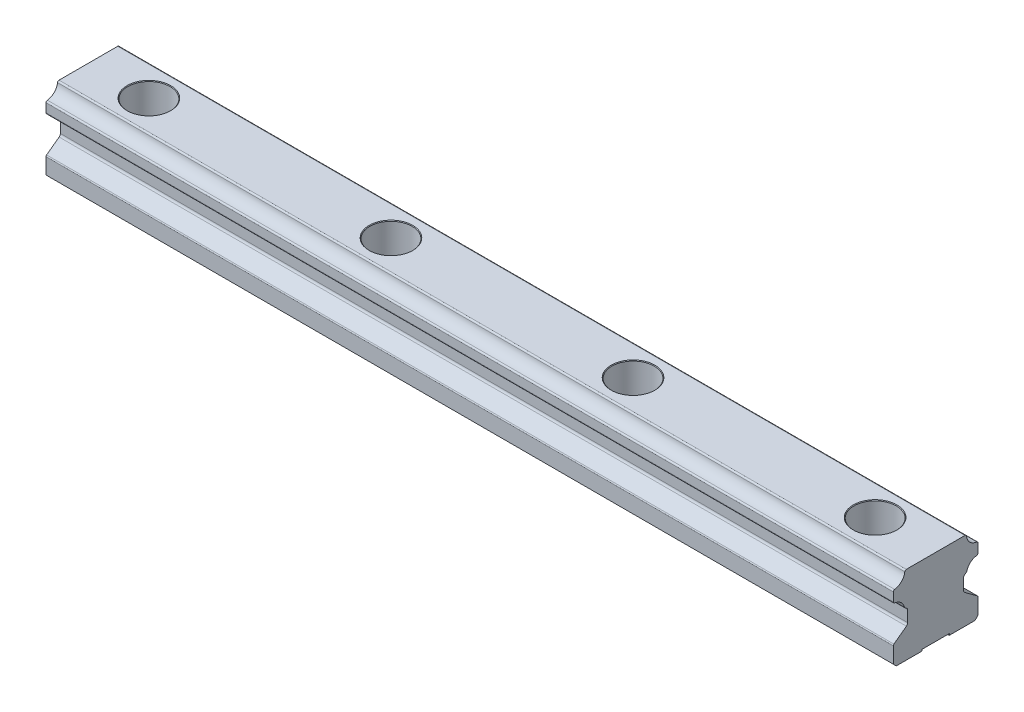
ISO-10303-21;
HEADER;
FILE_DESCRIPTION(('STEP AP214'),'2;1');
FILE_NAME('part.step','',(''),(''),'','','');
FILE_SCHEMA(('AUTOMOTIVE_DESIGN { 1 0 10303 214 1 1 1 1 }'));
ENDSEC;
DATA;
#1=APPLICATION_CONTEXT('core data for automotive mechanical design processes');
#2=APPLICATION_PROTOCOL_DEFINITION('international standard','automotive_design',2000,#1);
#3=PRODUCT_CONTEXT('',#1,'mechanical');
#4=PRODUCT('Part','Part','',(#3));
#5=PRODUCT_RELATED_PRODUCT_CATEGORY('part','',(#4));
#6=PRODUCT_DEFINITION_FORMATION('','',#4);
#7=PRODUCT_DEFINITION_CONTEXT('part definition',#1,'design');
#8=PRODUCT_DEFINITION('design','',#6,#7);
#9=PRODUCT_DEFINITION_SHAPE('','',#8);
#10=(LENGTH_UNIT() NAMED_UNIT(*) SI_UNIT(.MILLI.,.METRE.));
#11=(NAMED_UNIT(*) PLANE_ANGLE_UNIT() SI_UNIT($,.RADIAN.));
#12=(NAMED_UNIT(*) SI_UNIT($,.STERADIAN.) SOLID_ANGLE_UNIT());
#13=UNCERTAINTY_MEASURE_WITH_UNIT(LENGTH_MEASURE(1.E-05),#10,'distance_accuracy_value','');
#14=(GEOMETRIC_REPRESENTATION_CONTEXT(3) GLOBAL_UNCERTAINTY_ASSIGNED_CONTEXT((#13)) GLOBAL_UNIT_ASSIGNED_CONTEXT((#10,
#11,#12)) REPRESENTATION_CONTEXT('',''));
#15=CARTESIAN_POINT('',(0.,0.,0.));
#16=DIRECTION('',(0.,0.,1.));
#17=DIRECTION('',(1.,0.,0.));
#18=AXIS2_PLACEMENT_3D('',#15,#16,#17);
#19=CARTESIAN_POINT('',(280.,0.,-4.5));
#20=DIRECTION('',(0.,0.,1.));
#21=DIRECTION('',(1.,0.,0.));
#22=AXIS2_PLACEMENT_3D('',#19,#20,#21);
#23=PLANE('',#22);
#24=DIRECTION('',(-1.,0.,0.));
#25=VECTOR('',#24,1.);
#26=CARTESIAN_POINT('',(280.,0.5,-4.5));
#27=LINE('',#26,#25);
#28=CARTESIAN_POINT('',(19.7878090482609,0.5,-4.5));
#29=VERTEX_POINT('',#28);
#30=CARTESIAN_POINT('',(0.,0.5,-4.5));
#31=VERTEX_POINT('',#30);
#32=EDGE_CURVE('E11',#29,#31,#27,.T.);
#33=ORIENTED_EDGE('',*,*,#32,.T.);
#34=DIRECTION('',(0.,1.,0.));
#35=VECTOR('',#34,1.);
#36=CARTESIAN_POINT('',(0.,0.,-4.5));
#37=LINE('',#36,#35);
#38=CARTESIAN_POINT('',(0.,0.,-4.5));
#39=VERTEX_POINT('',#38);
#40=EDGE_CURVE('E43',#39,#31,#37,.T.);
#41=ORIENTED_EDGE('',*,*,#40,.F.);
#42=DIRECTION('',(-1.,0.,0.));
#43=VECTOR('',#42,1.);
#44=CARTESIAN_POINT('',(280.,0.,-4.5));
#45=LINE('',#44,#43);
#46=CARTESIAN_POINT('',(18.6263097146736,0.,-4.5));
#47=VERTEX_POINT('',#46);
#48=EDGE_CURVE('E1246',#47,#39,#45,.T.);
#49=ORIENTED_EDGE('',*,*,#48,.F.);
#50=CARTESIAN_POINT('',(19.7878090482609,0.200000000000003,-4.5));
#51=CARTESIAN_POINT('',(19.739404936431,0.197723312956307,-4.49999868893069));
#52=CARTESIAN_POINT('',(19.6910370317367,0.194681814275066,-4.49998175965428));
#53=CARTESIAN_POINT('',(19.5944748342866,0.187084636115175,-4.49993533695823));
#54=CARTESIAN_POINT('',(19.5462804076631,0.182530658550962,-4.49990585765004));
#55=CARTESIAN_POINT('',(19.4499712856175,0.171909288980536,-4.49985287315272));
#56=CARTESIAN_POINT('',(19.4018568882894,0.165839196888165,-4.49982937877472));
#57=CARTESIAN_POINT('',(19.3056146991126,0.152190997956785,-4.49979757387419));
#58=CARTESIAN_POINT('',(19.2574878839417,0.144606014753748,-4.49978933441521));
#59=CARTESIAN_POINT('',(19.1611295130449,0.127931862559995,-4.49979083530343));
#60=CARTESIAN_POINT('',(19.1128998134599,0.118831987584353,-4.49980070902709));
#61=CARTESIAN_POINT('',(19.0162461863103,0.0991318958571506,-4.49983447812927));
#62=CARTESIAN_POINT('',(18.9678251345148,0.0885175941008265,-4.49985851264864));
#63=CARTESIAN_POINT('',(18.870702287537,0.0657916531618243,-4.49991081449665));
#64=CARTESIAN_POINT('',(18.8220044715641,0.0536630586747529,-4.49993913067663));
#65=CARTESIAN_POINT('',(18.7242422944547,0.0279120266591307,-4.49998347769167));
#66=CARTESIAN_POINT('',(18.6751830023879,0.0142703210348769,-4.4999993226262));
#67=CARTESIAN_POINT('',(18.6263097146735,5.36002449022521E-13,-4.50000000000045));
#68=B_SPLINE_CURVE_WITH_KNOTS('',3,(#50,#51,#52,#53,#54,#55,#56,#57,#58,#59,#60,#61,#62,#63,#64,
#65,#66,#67),.UNSPECIFIED.,.F.,.F.,(4,2,2,2,2,2,2,2,4),(0.,0.145366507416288,0.290569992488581,
0.436033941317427,0.582173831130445,0.72939414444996,0.878085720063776,1.02862352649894,
1.18136490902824),.UNSPECIFIED.);
#69=CARTESIAN_POINT('',(19.7878090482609,0.2,-4.5));
#70=VERTEX_POINT('',#69);
#71=EDGE_CURVE('E650',#70,#47,#68,.T.);
#72=ORIENTED_EDGE('',*,*,#71,.F.);
#73=DIRECTION('',(0.,-1.,0.));
#74=VECTOR('',#73,1.);
#75=CARTESIAN_POINT('',(19.7878090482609,0.,-4.5));
#76=LINE('',#75,#74);
#77=EDGE_CURVE('E655',#29,#70,#76,.T.);
#78=ORIENTED_EDGE('',*,*,#77,.F.);
#79=EDGE_LOOP('',(#33,#41,#49,#72,#78));
#80=FACE_BOUND('',#79,.T.);
#81=ADVANCED_FACE('F17',(#80),#23,.T.);
#82=CARTESIAN_POINT('',(260.,0.2,0.));
#83=DIRECTION('',(0.,-1.,0.));
#84=DIRECTION('',(0.,0.,-1.));
#85=AXIS2_PLACEMENT_3D('',#82,#83,#84);
#86=CONICAL_SURFACE('',#85,4.505,0.7853981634);
#87=CARTESIAN_POINT('',(260.,0.,0.));
#88=DIRECTION('',(0.,-1.,0.));
#89=DIRECTION('',(0.,0.,-1.));
#90=AXIS2_PLACEMENT_3D('',#87,#88,#89);
#91=CIRCLE('',#90,4.705);
#92=CARTESIAN_POINT('',(261.373690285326,0.,4.5));
#93=VERTEX_POINT('',#92);
#94=CARTESIAN_POINT('',(258.626309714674,0.,4.5));
#95=VERTEX_POINT('',#94);
#96=EDGE_CURVE('E29',#93,#95,#91,.T.);
#97=ORIENTED_EDGE('',*,*,#96,.T.);
#98=CARTESIAN_POINT('',(258.626309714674,5.66495635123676E-13,4.50000000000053));
#99=CARTESIAN_POINT('',(258.675183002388,0.0142703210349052,4.49999932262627));
#100=CARTESIAN_POINT('',(258.724242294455,0.0279120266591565,4.49998347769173));
#101=CARTESIAN_POINT('',(258.822004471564,0.053663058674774,4.49993913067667));
#102=CARTESIAN_POINT('',(258.870702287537,0.0657916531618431,4.49991081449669));
#103=CARTESIAN_POINT('',(258.967825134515,0.0885175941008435,4.49985851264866));
#104=CARTESIAN_POINT('',(259.01624618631,0.099131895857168,4.4998344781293));
#105=CARTESIAN_POINT('',(259.11289981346,0.118831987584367,4.4998007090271));
#106=CARTESIAN_POINT('',(259.161129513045,0.127931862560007,4.49979083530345));
#107=CARTESIAN_POINT('',(259.257487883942,0.144606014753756,4.49978933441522));
#108=CARTESIAN_POINT('',(259.305614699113,0.152190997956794,4.4997975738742));
#109=CARTESIAN_POINT('',(259.40185688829,0.165839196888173,4.49982937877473));
#110=CARTESIAN_POINT('',(259.449971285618,0.171909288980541,4.49985287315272));
#111=CARTESIAN_POINT('',(259.546280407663,0.182530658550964,4.49990585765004));
#112=CARTESIAN_POINT('',(259.594474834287,0.187084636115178,4.49993533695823));
#113=CARTESIAN_POINT('',(259.691037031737,0.194681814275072,4.49998175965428));
#114=CARTESIAN_POINT('',(259.739404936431,0.197723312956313,4.4999986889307));
#115=CARTESIAN_POINT('',(259.787809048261,0.200000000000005,4.50000000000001));
#116=B_SPLINE_CURVE_WITH_KNOTS('',3,(#98,#99,#100,#101,#102,#103,#104,#105,#106,#107,#108,#109,
#110,#111,#112,#113,#114,#115),.UNSPECIFIED.,.F.,.F.,(4,2,2,2,2,2,2,2,4),(0.,0.152741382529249,
0.303279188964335,0.451970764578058,0.599191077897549,0.745330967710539,0.890794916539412,
1.03599840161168,1.18136490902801),.UNSPECIFIED.);
#117=CARTESIAN_POINT('',(259.787809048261,0.2,4.5));
#118=VERTEX_POINT('',#117);
#119=EDGE_CURVE('E804',#95,#118,#116,.T.);
#120=ORIENTED_EDGE('',*,*,#119,.T.);
#121=CARTESIAN_POINT('',(260.,0.2,0.));
#122=DIRECTION('',(0.,-1.,0.));
#123=DIRECTION('',(0.,0.,-1.));
#124=AXIS2_PLACEMENT_3D('',#121,#122,#123);
#125=CIRCLE('',#124,4.505);
#126=CARTESIAN_POINT('',(260.212190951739,0.2,4.5));
#127=VERTEX_POINT('',#126);
#128=EDGE_CURVE('E814',#127,#118,#125,.T.);
#129=ORIENTED_EDGE('',*,*,#128,.F.);
#130=CARTESIAN_POINT('',(260.212190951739,0.200000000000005,4.50000000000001));
#131=CARTESIAN_POINT('',(260.260595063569,0.197723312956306,4.4999986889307));
#132=CARTESIAN_POINT('',(260.308962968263,0.194681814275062,4.49998175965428));
#133=CARTESIAN_POINT('',(260.405525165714,0.187084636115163,4.49993533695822));
#134=CARTESIAN_POINT('',(260.453719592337,0.182530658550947,4.49990585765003));
#135=CARTESIAN_POINT('',(260.550028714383,0.171909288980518,4.49985287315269));
#136=CARTESIAN_POINT('',(260.598143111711,0.165839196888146,4.49982937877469));
#137=CARTESIAN_POINT('',(260.694385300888,0.152190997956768,4.49979757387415));
#138=CARTESIAN_POINT('',(260.742512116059,0.144606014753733,4.49978933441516));
#139=CARTESIAN_POINT('',(260.838870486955,0.127931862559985,4.49979083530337));
#140=CARTESIAN_POINT('',(260.88710018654,0.118831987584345,4.49980070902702));
#141=CARTESIAN_POINT('',(260.98375381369,0.0991318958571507,4.49983447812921));
#142=CARTESIAN_POINT('',(261.032174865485,0.088517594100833,4.49985851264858));
#143=CARTESIAN_POINT('',(261.129297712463,0.0657916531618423,4.4999108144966));
#144=CARTESIAN_POINT('',(261.177995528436,0.053663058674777,4.49993913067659));
#145=CARTESIAN_POINT('',(261.275757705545,0.0279120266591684,4.49998347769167));
#146=CARTESIAN_POINT('',(261.324816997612,0.0142703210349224,4.49999932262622));
#147=CARTESIAN_POINT('',(261.373690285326,5.91513600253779E-13,4.5000000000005));
#148=B_SPLINE_CURVE_WITH_KNOTS('',3,(#130,#131,#132,#133,#134,#135,#136,#137,#138,#139,#140,
#141,#142,#143,#144,#145,#146,#147),.UNSPECIFIED.,.F.,.F.,(4,2,2,2,2,2,2,2,4),(0.,
0.145366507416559,0.290569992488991,0.436033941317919,0.582173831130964,0.729394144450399,
0.878085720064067,1.02862352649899,1.18136490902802),.UNSPECIFIED.);
#149=EDGE_CURVE('E830',#127,#93,#148,.T.);
#150=ORIENTED_EDGE('',*,*,#149,.T.);
#151=EDGE_LOOP('',(#97,#120,#129,#150));
#152=FACE_BOUND('',#151,.T.);
#153=ADVANCED_FACE('F632',(#152),#86,.F.);
#154=CARTESIAN_POINT('',(100.,0.2,0.));
#155=DIRECTION('',(0.,-1.,0.));
#156=DIRECTION('',(0.,0.,-1.));
#157=AXIS2_PLACEMENT_3D('',#154,#155,#156);
#158=CONICAL_SURFACE('',#157,4.505,0.7853981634);
#159=CARTESIAN_POINT('',(100.,0.,0.));
#160=DIRECTION('',(0.,-1.,0.));
#161=DIRECTION('',(0.,0.,-1.));
#162=AXIS2_PLACEMENT_3D('',#159,#160,#161);
#163=CIRCLE('',#162,4.705);
#164=CARTESIAN_POINT('',(101.373690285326,0.,4.5));
#165=VERTEX_POINT('',#164);
#166=CARTESIAN_POINT('',(98.6263097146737,0.,4.5));
#167=VERTEX_POINT('',#166);
#168=EDGE_CURVE('E1647',#165,#167,#163,.T.);
#169=ORIENTED_EDGE('',*,*,#168,.T.);
#170=CARTESIAN_POINT('',(98.6263097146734,5.09005814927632E-13,4.50000000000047));
#171=CARTESIAN_POINT('',(98.6751830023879,0.0142703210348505,4.49999932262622));
#172=CARTESIAN_POINT('',(98.7242422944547,0.0279120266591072,4.49998347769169));
#173=CARTESIAN_POINT('',(98.8220044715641,0.0536630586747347,4.49993913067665));
#174=CARTESIAN_POINT('',(98.870702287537,0.0657916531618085,4.49991081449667));
#175=CARTESIAN_POINT('',(98.9678251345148,0.0885175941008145,4.49985851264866));
#176=CARTESIAN_POINT('',(99.0162461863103,0.0991318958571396,4.49983447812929));
#177=CARTESIAN_POINT('',(99.1128998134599,0.118831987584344,4.4998007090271));
#178=CARTESIAN_POINT('',(99.161129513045,0.127931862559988,4.49979083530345));
#179=CARTESIAN_POINT('',(99.2574878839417,0.144606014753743,4.49978933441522));
#180=CARTESIAN_POINT('',(99.3056146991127,0.152190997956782,4.4997975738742));
#181=CARTESIAN_POINT('',(99.4018568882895,0.165839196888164,4.49982937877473));
#182=CARTESIAN_POINT('',(99.4499712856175,0.171909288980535,4.49985287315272));
#183=CARTESIAN_POINT('',(99.5462804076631,0.182530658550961,4.49990585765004));
#184=CARTESIAN_POINT('',(99.5944748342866,0.187084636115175,4.49993533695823));
#185=CARTESIAN_POINT('',(99.6910370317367,0.194681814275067,4.49998175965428));
#186=CARTESIAN_POINT('',(99.739404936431,0.197723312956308,4.49999868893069));
#187=CARTESIAN_POINT('',(99.7878090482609,0.200000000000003,4.5));
#188=B_SPLINE_CURVE_WITH_KNOTS('',3,(#170,#171,#172,#173,#174,#175,#176,#177,#178,#179,#180,
#181,#182,#183,#184,#185,#186,#187),.UNSPECIFIED.,.F.,.F.,(4,2,2,2,2,2,2,2,4),(0.,
0.152741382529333,0.303279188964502,0.451970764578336,0.599191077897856,0.74533096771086,
0.890794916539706,1.03599840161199,1.18136490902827),.UNSPECIFIED.);
#189=CARTESIAN_POINT('',(99.7878090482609,0.2,4.5));
#190=VERTEX_POINT('',#189);
#191=EDGE_CURVE('E1651',#167,#190,#188,.T.);
#192=ORIENTED_EDGE('',*,*,#191,.T.);
#193=CARTESIAN_POINT('',(100.,0.2,0.));
#194=DIRECTION('',(0.,-1.,0.));
#195=DIRECTION('',(0.,0.,-1.));
#196=AXIS2_PLACEMENT_3D('',#193,#194,#195);
#197=CIRCLE('',#196,4.505);
#198=CARTESIAN_POINT('',(100.212190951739,0.2,4.5));
#199=VERTEX_POINT('',#198);
#200=EDGE_CURVE('E1630',#199,#190,#197,.T.);
#201=ORIENTED_EDGE('',*,*,#200,.F.);
#202=CARTESIAN_POINT('',(100.212190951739,0.200000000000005,4.50000000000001));
#203=CARTESIAN_POINT('',(100.260595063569,0.197723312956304,4.4999986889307));
#204=CARTESIAN_POINT('',(100.308962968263,0.194681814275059,4.49998175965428));
#205=CARTESIAN_POINT('',(100.405525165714,0.187084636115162,4.49993533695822));
#206=CARTESIAN_POINT('',(100.453719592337,0.182530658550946,4.49990585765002));
#207=CARTESIAN_POINT('',(100.550028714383,0.171909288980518,4.49985287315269));
#208=CARTESIAN_POINT('',(100.598143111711,0.165839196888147,4.49982937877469));
#209=CARTESIAN_POINT('',(100.694385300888,0.152190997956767,4.49979757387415));
#210=CARTESIAN_POINT('',(100.742512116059,0.144606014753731,4.49978933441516));
#211=CARTESIAN_POINT('',(100.838870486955,0.127931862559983,4.49979083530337));
#212=CARTESIAN_POINT('',(100.887100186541,0.118831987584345,4.49980070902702));
#213=CARTESIAN_POINT('',(100.98375381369,0.0991318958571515,4.49983447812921));
#214=CARTESIAN_POINT('',(101.032174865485,0.0885175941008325,4.49985851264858));
#215=CARTESIAN_POINT('',(101.129297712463,0.0657916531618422,4.4999108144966));
#216=CARTESIAN_POINT('',(101.177995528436,0.0536630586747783,4.49993913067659));
#217=CARTESIAN_POINT('',(101.275757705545,0.0279120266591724,4.49998347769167));
#218=CARTESIAN_POINT('',(101.324816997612,0.0142703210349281,4.49999932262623));
#219=CARTESIAN_POINT('',(101.373690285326,5.93492269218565E-13,4.50000000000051));
#220=B_SPLINE_CURVE_WITH_KNOTS('',3,(#202,#203,#204,#205,#206,#207,#208,#209,#210,#211,#212,
#213,#214,#215,#216,#217,#218,#219),.UNSPECIFIED.,.F.,.F.,(4,2,2,2,2,2,2,2,4),(0.,
0.145366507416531,0.290569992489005,0.436033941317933,0.58217383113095,0.729394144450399,
0.878085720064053,1.02862352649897,1.18136490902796),.UNSPECIFIED.);
#221=EDGE_CURVE('E696',#199,#165,#220,.T.);
#222=ORIENTED_EDGE('',*,*,#221,.T.);
#223=EDGE_LOOP('',(#169,#192,#201,#222));
#224=FACE_BOUND('',#223,.T.);
#225=ADVANCED_FACE('F665',(#224),#158,.F.);
#226=CARTESIAN_POINT('',(20.,0.2,0.));
#227=DIRECTION('',(0.,-1.,0.));
#228=DIRECTION('',(0.,0.,-1.));
#229=AXIS2_PLACEMENT_3D('',#226,#227,#228);
#230=CONICAL_SURFACE('',#229,4.505,0.7853981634);
#231=CARTESIAN_POINT('',(20.,0.,0.));
#232=DIRECTION('',(0.,-1.,0.));
#233=DIRECTION('',(0.,0.,-1.));
#234=AXIS2_PLACEMENT_3D('',#231,#232,#233);
#235=CIRCLE('',#234,4.705);
#236=CARTESIAN_POINT('',(21.3736902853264,0.,4.5));
#237=VERTEX_POINT('',#236);
#238=CARTESIAN_POINT('',(18.6263097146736,0.,4.5));
#239=VERTEX_POINT('',#238);
#240=EDGE_CURVE('E1664',#237,#239,#235,.T.);
#241=ORIENTED_EDGE('',*,*,#240,.T.);
#242=CARTESIAN_POINT('',(18.6263097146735,5.10008701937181E-13,4.50000000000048));
#243=CARTESIAN_POINT('',(18.6751830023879,0.0142703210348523,4.49999932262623));
#244=CARTESIAN_POINT('',(18.7242422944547,0.0279120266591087,4.4999834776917));
#245=CARTESIAN_POINT('',(18.8220044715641,0.0536630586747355,4.49993913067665));
#246=CARTESIAN_POINT('',(18.870702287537,0.065791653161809,4.49991081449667));
#247=CARTESIAN_POINT('',(18.9678251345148,0.0885175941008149,4.49985851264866));
#248=CARTESIAN_POINT('',(19.0162461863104,0.0991318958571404,4.49983447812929));
#249=CARTESIAN_POINT('',(19.1128998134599,0.118831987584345,4.4998007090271));
#250=CARTESIAN_POINT('',(19.161129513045,0.127931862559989,4.49979083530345));
#251=CARTESIAN_POINT('',(19.2574878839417,0.144606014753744,4.49978933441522));
#252=CARTESIAN_POINT('',(19.3056146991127,0.152190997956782,4.4997975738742));
#253=CARTESIAN_POINT('',(19.4018568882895,0.165839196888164,4.49982937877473));
#254=CARTESIAN_POINT('',(19.4499712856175,0.171909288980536,4.49985287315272));
#255=CARTESIAN_POINT('',(19.5462804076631,0.182530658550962,4.49990585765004));
#256=CARTESIAN_POINT('',(19.5944748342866,0.187084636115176,4.49993533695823));
#257=CARTESIAN_POINT('',(19.6910370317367,0.194681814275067,4.49998175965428));
#258=CARTESIAN_POINT('',(19.739404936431,0.197723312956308,4.49999868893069));
#259=CARTESIAN_POINT('',(19.7878090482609,0.200000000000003,4.5));
#260=B_SPLINE_CURVE_WITH_KNOTS('',3,(#242,#243,#244,#245,#246,#247,#248,#249,#250,#251,#252,
#253,#254,#255,#256,#257,#258,#259),.UNSPECIFIED.,.F.,.F.,(4,2,2,2,2,2,2,2,4),(0.,
0.152741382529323,0.303279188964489,0.451970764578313,0.599191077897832,0.745330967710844,
0.890794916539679,1.03599840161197,1.18136490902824),.UNSPECIFIED.);
#261=CARTESIAN_POINT('',(19.7878090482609,0.2,4.5));
#262=VERTEX_POINT('',#261);
#263=EDGE_CURVE('E1666',#239,#262,#260,.T.);
#264=ORIENTED_EDGE('',*,*,#263,.T.);
#265=CARTESIAN_POINT('',(20.,0.2,0.));
#266=DIRECTION('',(0.,-1.,0.));
#267=DIRECTION('',(0.,0.,-1.));
#268=AXIS2_PLACEMENT_3D('',#265,#266,#267);
#269=CIRCLE('',#268,4.505);
#270=CARTESIAN_POINT('',(20.2121909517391,0.2,4.5));
#271=VERTEX_POINT('',#270);
#272=EDGE_CURVE('E1579',#271,#262,#269,.T.);
#273=ORIENTED_EDGE('',*,*,#272,.F.);
#274=CARTESIAN_POINT('',(20.2121909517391,0.200000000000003,4.5));
#275=CARTESIAN_POINT('',(20.260595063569,0.197723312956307,4.49999868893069));
#276=CARTESIAN_POINT('',(20.3089629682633,0.194681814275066,4.49998175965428));
#277=CARTESIAN_POINT('',(20.4055251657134,0.187084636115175,4.49993533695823));
#278=CARTESIAN_POINT('',(20.4537195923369,0.182530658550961,4.49990585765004));
#279=CARTESIAN_POINT('',(20.5500287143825,0.171909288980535,4.49985287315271));
#280=CARTESIAN_POINT('',(20.5981431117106,0.165839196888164,4.49982937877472));
#281=CARTESIAN_POINT('',(20.6943853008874,0.152190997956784,4.49979757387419));
#282=CARTESIAN_POINT('',(20.7425121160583,0.144606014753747,4.49978933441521));
#283=CARTESIAN_POINT('',(20.8388704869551,0.127931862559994,4.49979083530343));
#284=CARTESIAN_POINT('',(20.8871001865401,0.118831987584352,4.49980070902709));
#285=CARTESIAN_POINT('',(20.9837538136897,0.09913189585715,4.49983447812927));
#286=CARTESIAN_POINT('',(21.0321748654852,0.088517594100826,4.49985851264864));
#287=CARTESIAN_POINT('',(21.129297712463,0.0657916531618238,4.49991081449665));
#288=CARTESIAN_POINT('',(21.1779955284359,0.0536630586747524,4.49993913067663));
#289=CARTESIAN_POINT('',(21.2757577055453,0.0279120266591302,4.49998347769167));
#290=CARTESIAN_POINT('',(21.3248169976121,0.0142703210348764,4.4999993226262));
#291=CARTESIAN_POINT('',(21.3736902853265,5.36002449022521E-13,4.50000000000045));
#292=B_SPLINE_CURVE_WITH_KNOTS('',3,(#274,#275,#276,#277,#278,#279,#280,#281,#282,#283,#284,
#285,#286,#287,#288,#289,#290,#291),.UNSPECIFIED.,.F.,.F.,(4,2,2,2,2,2,2,2,4),(0.,
0.145366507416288,0.290569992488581,0.436033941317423,0.582173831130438,0.729394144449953,
0.878085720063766,1.02862352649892,1.18136490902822),.UNSPECIFIED.);
#293=EDGE_CURVE('E1368',#271,#237,#292,.T.);
#294=ORIENTED_EDGE('',*,*,#293,.T.);
#295=EDGE_LOOP('',(#241,#264,#273,#294));
#296=FACE_BOUND('',#295,.T.);
#297=ADVANCED_FACE('F669',(#296),#230,.F.);
#298=CARTESIAN_POINT('',(20.,0.,0.));
#299=DIRECTION('',(0.,1.,0.));
#300=DIRECTION('',(0.,0.,-1.));
#301=AXIS2_PLACEMENT_3D('',#298,#299,#300);
#302=CYLINDRICAL_SURFACE('',#301,4.505);
#303=CARTESIAN_POINT('',(20.,14.,0.));
#304=DIRECTION('',(0.,-1.,0.));
#305=DIRECTION('',(0.,0.,-1.));
#306=AXIS2_PLACEMENT_3D('',#303,#304,#305);
#307=CIRCLE('',#306,4.505);
#308=CARTESIAN_POINT('',(20.,14.,-4.505));
#309=VERTEX_POINT('',#308);
#310=EDGE_CURVE('E1108',#309,#309,#307,.T.);
#311=ORIENTED_EDGE('',*,*,#310,.F.);
#312=EDGE_LOOP('',(#311));
#313=FACE_BOUND('',#312,.T.);
#314=CARTESIAN_POINT('',(20.,0.5,0.));
#315=DIRECTION('',(0.,-1.,0.));
#316=DIRECTION('',(0.,0.,-1.));
#317=AXIS2_PLACEMENT_3D('',#314,#315,#316);
#318=CIRCLE('',#317,4.505);
#319=CARTESIAN_POINT('',(20.2121909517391,0.5,-4.5));
#320=VERTEX_POINT('',#319);
#321=CARTESIAN_POINT('',(20.2121909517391,0.5,4.5));
#322=VERTEX_POINT('',#321);
#323=EDGE_CURVE('E1364',#320,#322,#318,.T.);
#324=ORIENTED_EDGE('',*,*,#323,.T.);
#325=DIRECTION('',(0.,-1.,0.));
#326=VECTOR('',#325,1.);
#327=CARTESIAN_POINT('',(20.2121909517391,0.,4.5));
#328=LINE('',#327,#326);
#329=EDGE_CURVE('E1369',#322,#271,#328,.T.);
#330=ORIENTED_EDGE('',*,*,#329,.T.);
#331=ORIENTED_EDGE('',*,*,#272,.T.);
#332=DIRECTION('',(0.,1.,0.));
#333=VECTOR('',#332,1.);
#334=CARTESIAN_POINT('',(19.7878090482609,0.,4.5));
#335=LINE('',#334,#333);
#336=CARTESIAN_POINT('',(19.7878090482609,0.5,4.5));
#337=VERTEX_POINT('',#336);
#338=EDGE_CURVE('E950',#262,#337,#335,.T.);
#339=ORIENTED_EDGE('',*,*,#338,.T.);
#340=CARTESIAN_POINT('',(20.,0.5,0.));
#341=DIRECTION('',(0.,-1.,0.));
#342=DIRECTION('',(0.,0.,-1.));
#343=AXIS2_PLACEMENT_3D('',#340,#341,#342);
#344=CIRCLE('',#343,4.505);
#345=EDGE_CURVE('E947',#337,#29,#344,.T.);
#346=ORIENTED_EDGE('',*,*,#345,.T.);
#347=ORIENTED_EDGE('',*,*,#77,.T.);
#348=CARTESIAN_POINT('',(20.,0.2,0.));
#349=DIRECTION('',(0.,-1.,0.));
#350=DIRECTION('',(0.,0.,-1.));
#351=AXIS2_PLACEMENT_3D('',#348,#349,#350);
#352=CIRCLE('',#351,4.505);
#353=CARTESIAN_POINT('',(20.2121909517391,0.2,-4.5));
#354=VERTEX_POINT('',#353);
#355=EDGE_CURVE('E2580',#70,#354,#352,.T.);
#356=ORIENTED_EDGE('',*,*,#355,.T.);
#357=DIRECTION('',(0.,1.,0.));
#358=VECTOR('',#357,1.);
#359=CARTESIAN_POINT('',(20.2121909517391,0.,-4.5));
#360=LINE('',#359,#358);
#361=EDGE_CURVE('E1312',#354,#320,#360,.T.);
#362=ORIENTED_EDGE('',*,*,#361,.T.);
#363=EDGE_LOOP('',(#324,#330,#331,#339,#346,#347,#356,#362));
#364=FACE_BOUND('',#363,.T.);
#365=ADVANCED_FACE('F1617',(#313,#364),#302,.F.);
#366=CARTESIAN_POINT('',(27.005,14.,0.));
#367=DIRECTION('',(0.,1.,0.));
#368=DIRECTION('',(1.,0.,0.));
#369=AXIS2_PLACEMENT_3D('',#366,#367,#368);
#370=PLANE('',#369);
#371=CARTESIAN_POINT('',(20.,14.,0.));
#372=DIRECTION('',(0.,-1.,0.));
#373=DIRECTION('',(0.,0.,-1.));
#374=AXIS2_PLACEMENT_3D('',#371,#372,#373);
#375=CIRCLE('',#374,7.005);
#376=CARTESIAN_POINT('',(20.,14.,-7.005));
#377=VERTEX_POINT('',#376);
#378=EDGE_CURVE('E1104',#377,#377,#375,.T.);
#379=ORIENTED_EDGE('',*,*,#378,.F.);
#380=EDGE_LOOP('',(#379));
#381=FACE_BOUND('',#380,.T.);
#382=ORIENTED_EDGE('',*,*,#310,.T.);
#383=EDGE_LOOP('',(#382));
#384=FACE_BOUND('',#383,.T.);
#385=ADVANCED_FACE('F1818',(#381,#384),#370,.T.);
#386=CARTESIAN_POINT('',(20.,0.,0.));
#387=DIRECTION('',(0.,1.,0.));
#388=DIRECTION('',(0.,0.,-1.));
#389=AXIS2_PLACEMENT_3D('',#386,#387,#388);
#390=CYLINDRICAL_SURFACE('',#389,7.005);
#391=CARTESIAN_POINT('',(20.,25.8,0.));
#392=DIRECTION('',(0.,-1.,0.));
#393=DIRECTION('',(0.,0.,-1.));
#394=AXIS2_PLACEMENT_3D('',#391,#392,#393);
#395=CIRCLE('',#394,7.005);
#396=CARTESIAN_POINT('',(20.,25.8,-7.005));
#397=VERTEX_POINT('',#396);
#398=EDGE_CURVE('E1109',#397,#397,#395,.T.);
#399=ORIENTED_EDGE('',*,*,#398,.F.);
#400=EDGE_LOOP('',(#399));
#401=FACE_BOUND('',#400,.T.);
#402=ORIENTED_EDGE('',*,*,#378,.T.);
#403=EDGE_LOOP('',(#402));
#404=FACE_BOUND('',#403,.T.);
#405=ADVANCED_FACE('F1822',(#401,#404),#390,.F.);
#406=CARTESIAN_POINT('',(20.,26.,0.));
#407=DIRECTION('',(0.,1.,0.));
#408=DIRECTION('',(0.,0.,1.));
#409=AXIS2_PLACEMENT_3D('',#406,#407,#408);
#410=CONICAL_SURFACE('',#409,7.205,0.7853981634);
#411=CARTESIAN_POINT('',(20.,26.,0.));
#412=DIRECTION('',(0.,-1.,0.));
#413=DIRECTION('',(0.,0.,-1.));
#414=AXIS2_PLACEMENT_3D('',#411,#412,#413);
#415=CIRCLE('',#414,7.205);
#416=CARTESIAN_POINT('',(20.,26.,-7.205));
#417=VERTEX_POINT('',#416);
#418=EDGE_CURVE('E1082',#417,#417,#415,.T.);
#419=ORIENTED_EDGE('',*,*,#418,.F.);
#420=EDGE_LOOP('',(#419));
#421=FACE_BOUND('',#420,.T.);
#422=ORIENTED_EDGE('',*,*,#398,.T.);
#423=EDGE_LOOP('',(#422));
#424=FACE_BOUND('',#423,.T.);
#425=ADVANCED_FACE('F1939',(#421,#424),#410,.F.);
#426=CARTESIAN_POINT('',(187.005,14.,0.));
#427=DIRECTION('',(0.,1.,0.));
#428=DIRECTION('',(1.,0.,0.));
#429=AXIS2_PLACEMENT_3D('',#426,#427,#428);
#430=PLANE('',#429);
#431=CARTESIAN_POINT('',(180.,14.,0.));
#432=DIRECTION('',(0.,-1.,0.));
#433=DIRECTION('',(0.,0.,-1.));
#434=AXIS2_PLACEMENT_3D('',#431,#432,#433);
#435=CIRCLE('',#434,7.005);
#436=CARTESIAN_POINT('',(180.,14.,-7.005));
#437=VERTEX_POINT('',#436);
#438=EDGE_CURVE('E1175',#437,#437,#435,.T.);
#439=ORIENTED_EDGE('',*,*,#438,.F.);
#440=EDGE_LOOP('',(#439));
#441=FACE_BOUND('',#440,.T.);
#442=CARTESIAN_POINT('',(180.,14.,0.));
#443=DIRECTION('',(0.,-1.,0.));
#444=DIRECTION('',(0.,0.,-1.));
#445=AXIS2_PLACEMENT_3D('',#442,#443,#444);
#446=CIRCLE('',#445,4.505);
#447=CARTESIAN_POINT('',(180.,14.,-4.505));
#448=VERTEX_POINT('',#447);
#449=EDGE_CURVE('E1286',#448,#448,#446,.T.);
#450=ORIENTED_EDGE('',*,*,#449,.T.);
#451=EDGE_LOOP('',(#450));
#452=FACE_BOUND('',#451,.T.);
#453=ADVANCED_FACE('F868',(#441,#452),#430,.T.);
#454=CARTESIAN_POINT('',(280.,0.,13.));
#455=DIRECTION('',(0.,1.,0.));
#456=DIRECTION('',(1.,0.,0.));
#457=AXIS2_PLACEMENT_3D('',#454,#455,#456);
#458=PLANE('',#457);
#459=DIRECTION('',(-1.,0.,0.));
#460=VECTOR('',#459,1.);
#461=CARTESIAN_POINT('',(280.,0.,4.5));
#462=LINE('',#461,#460);
#463=CARTESIAN_POINT('',(280.,0.,4.5));
#464=VERTEX_POINT('',#463);
#465=EDGE_CURVE('E1351',#464,#93,#462,.T.);
#466=ORIENTED_EDGE('',*,*,#465,.F.);
#467=DIRECTION('',(0.,0.,-1.));
#468=VECTOR('',#467,1.);
#469=CARTESIAN_POINT('',(280.,0.,13.));
#470=LINE('',#469,#468);
#471=CARTESIAN_POINT('',(280.,0.,13.));
#472=VERTEX_POINT('',#471);
#473=EDGE_CURVE('E1027',#472,#464,#470,.T.);
#474=ORIENTED_EDGE('',*,*,#473,.F.);
#475=DIRECTION('',(-1.,0.,0.));
#476=VECTOR('',#475,1.);
#477=CARTESIAN_POINT('',(280.,0.,13.));
#478=LINE('',#477,#476);
#479=CARTESIAN_POINT('',(0.,0.,13.));
#480=VERTEX_POINT('',#479);
#481=EDGE_CURVE('E1360',#472,#480,#478,.T.);
#482=ORIENTED_EDGE('',*,*,#481,.T.);
#483=DIRECTION('',(0.,0.,-1.));
#484=VECTOR('',#483,1.);
#485=CARTESIAN_POINT('',(0.,0.,13.));
#486=LINE('',#485,#484);
#487=CARTESIAN_POINT('',(0.,0.,4.5));
#488=VERTEX_POINT('',#487);
#489=EDGE_CURVE('E1356',#480,#488,#486,.T.);
#490=ORIENTED_EDGE('',*,*,#489,.T.);
#491=DIRECTION('',(-1.,0.,0.));
#492=VECTOR('',#491,1.);
#493=CARTESIAN_POINT('',(280.,0.,4.5));
#494=LINE('',#493,#492);
#495=EDGE_CURVE('E1558',#239,#488,#494,.T.);
#496=ORIENTED_EDGE('',*,*,#495,.F.);
#497=ORIENTED_EDGE('',*,*,#240,.F.);
#498=DIRECTION('',(-1.,0.,0.));
#499=VECTOR('',#498,1.);
#500=CARTESIAN_POINT('',(280.,0.,4.5));
#501=LINE('',#500,#499);
#502=EDGE_CURVE('E1054',#167,#237,#501,.T.);
#503=ORIENTED_EDGE('',*,*,#502,.F.);
#504=ORIENTED_EDGE('',*,*,#168,.F.);
#505=DIRECTION('',(-1.,0.,0.));
#506=VECTOR('',#505,1.);
#507=CARTESIAN_POINT('',(280.,0.,4.5));
#508=LINE('',#507,#506);
#509=CARTESIAN_POINT('',(178.626309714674,0.,4.5));
#510=VERTEX_POINT('',#509);
#511=EDGE_CURVE('E1227',#510,#165,#508,.T.);
#512=ORIENTED_EDGE('',*,*,#511,.F.);
#513=CARTESIAN_POINT('',(180.,0.,0.));
#514=DIRECTION('',(0.,-1.,0.));
#515=DIRECTION('',(0.,0.,-1.));
#516=AXIS2_PLACEMENT_3D('',#513,#514,#515);
#517=CIRCLE('',#516,4.705);
#518=CARTESIAN_POINT('',(181.373690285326,0.,4.5));
#519=VERTEX_POINT('',#518);
#520=EDGE_CURVE('E725',#519,#510,#517,.T.);
#521=ORIENTED_EDGE('',*,*,#520,.F.);
#522=DIRECTION('',(-1.,0.,0.));
#523=VECTOR('',#522,1.);
#524=CARTESIAN_POINT('',(280.,0.,4.5));
#525=LINE('',#524,#523);
#526=EDGE_CURVE('E807',#95,#519,#525,.T.);
#527=ORIENTED_EDGE('',*,*,#526,.F.);
#528=ORIENTED_EDGE('',*,*,#96,.F.);
#529=EDGE_LOOP('',(#466,#474,#482,#490,#496,#497,#503,#504,#512,#521,#527,#528));
#530=FACE_BOUND('',#529,.T.);
#531=ADVANCED_FACE('F1663',(#530),#458,.F.);
#532=CARTESIAN_POINT('',(280.,0.,13.));
#533=DIRECTION('',(0.,1.,0.));
#534=DIRECTION('',(1.,0.,0.));
#535=AXIS2_PLACEMENT_3D('',#532,#533,#534);
#536=PLANE('',#535);
#537=ORIENTED_EDGE('',*,*,#48,.T.);
#538=DIRECTION('',(0.,0.,-1.));
#539=VECTOR('',#538,1.);
#540=CARTESIAN_POINT('',(0.,0.,13.));
#541=LINE('',#540,#539);
#542=CARTESIAN_POINT('',(0.,0.,-13.));
#543=VERTEX_POINT('',#542);
#544=EDGE_CURVE('E1242',#39,#543,#541,.T.);
#545=ORIENTED_EDGE('',*,*,#544,.T.);
#546=DIRECTION('',(-1.,0.,0.));
#547=VECTOR('',#546,1.);
#548=CARTESIAN_POINT('',(280.,0.,-13.));
#549=LINE('',#548,#547);
#550=CARTESIAN_POINT('',(280.,0.,-13.));
#551=VERTEX_POINT('',#550);
#552=EDGE_CURVE('E1018',#551,#543,#549,.T.);
#553=ORIENTED_EDGE('',*,*,#552,.F.);
#554=DIRECTION('',(0.,0.,-1.));
#555=VECTOR('',#554,1.);
#556=CARTESIAN_POINT('',(280.,0.,13.));
#557=LINE('',#556,#555);
#558=CARTESIAN_POINT('',(280.,0.,-4.5));
#559=VERTEX_POINT('',#558);
#560=EDGE_CURVE('E1023',#559,#551,#557,.T.);
#561=ORIENTED_EDGE('',*,*,#560,.F.);
#562=DIRECTION('',(-1.,0.,0.));
#563=VECTOR('',#562,1.);
#564=CARTESIAN_POINT('',(280.,0.,-4.5));
#565=LINE('',#564,#563);
#566=CARTESIAN_POINT('',(261.373690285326,0.,-4.5));
#567=VERTEX_POINT('',#566);
#568=EDGE_CURVE('E911',#559,#567,#565,.T.);
#569=ORIENTED_EDGE('',*,*,#568,.T.);
#570=CARTESIAN_POINT('',(260.,0.,0.));
#571=DIRECTION('',(0.,-1.,0.));
#572=DIRECTION('',(0.,0.,-1.));
#573=AXIS2_PLACEMENT_3D('',#570,#571,#572);
#574=CIRCLE('',#573,4.705);
#575=CARTESIAN_POINT('',(258.626309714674,0.,-4.5));
#576=VERTEX_POINT('',#575);
#577=EDGE_CURVE('E2640',#576,#567,#574,.T.);
#578=ORIENTED_EDGE('',*,*,#577,.F.);
#579=DIRECTION('',(-1.,0.,0.));
#580=VECTOR('',#579,1.);
#581=CARTESIAN_POINT('',(280.,0.,-4.5));
#582=LINE('',#581,#580);
#583=CARTESIAN_POINT('',(181.373690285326,0.,-4.5));
#584=VERTEX_POINT('',#583);
#585=EDGE_CURVE('E907',#576,#584,#582,.T.);
#586=ORIENTED_EDGE('',*,*,#585,.T.);
#587=CARTESIAN_POINT('',(180.,0.,0.));
#588=DIRECTION('',(0.,-1.,0.));
#589=DIRECTION('',(0.,0.,-1.));
#590=AXIS2_PLACEMENT_3D('',#587,#588,#589);
#591=CIRCLE('',#590,4.705);
#592=CARTESIAN_POINT('',(178.626309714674,0.,-4.5));
#593=VERTEX_POINT('',#592);
#594=EDGE_CURVE('E2612',#593,#584,#591,.T.);
#595=ORIENTED_EDGE('',*,*,#594,.F.);
#596=DIRECTION('',(-1.,0.,0.));
#597=VECTOR('',#596,1.);
#598=CARTESIAN_POINT('',(280.,0.,-4.5));
#599=LINE('',#598,#597);
#600=CARTESIAN_POINT('',(101.373690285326,0.,-4.5));
#601=VERTEX_POINT('',#600);
#602=EDGE_CURVE('E912',#593,#601,#599,.T.);
#603=ORIENTED_EDGE('',*,*,#602,.T.);
#604=CARTESIAN_POINT('',(100.,0.,0.));
#605=DIRECTION('',(0.,-1.,0.));
#606=DIRECTION('',(0.,0.,-1.));
#607=AXIS2_PLACEMENT_3D('',#604,#605,#606);
#608=CIRCLE('',#607,4.705);
#609=CARTESIAN_POINT('',(98.6263097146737,0.,-4.5));
#610=VERTEX_POINT('',#609);
#611=EDGE_CURVE('E502',#610,#601,#608,.T.);
#612=ORIENTED_EDGE('',*,*,#611,.F.);
#613=DIRECTION('',(-1.,0.,0.));
#614=VECTOR('',#613,1.);
#615=CARTESIAN_POINT('',(280.,0.,-4.5));
#616=LINE('',#615,#614);
#617=CARTESIAN_POINT('',(21.3736902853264,0.,-4.5));
#618=VERTEX_POINT('',#617);
#619=EDGE_CURVE('E1148',#610,#618,#616,.T.);
#620=ORIENTED_EDGE('',*,*,#619,.T.);
#621=CARTESIAN_POINT('',(20.,0.,0.));
#622=DIRECTION('',(0.,-1.,0.));
#623=DIRECTION('',(0.,0.,-1.));
#624=AXIS2_PLACEMENT_3D('',#621,#622,#623);
#625=CIRCLE('',#624,4.705);
#626=EDGE_CURVE('E2569',#47,#618,#625,.T.);
#627=ORIENTED_EDGE('',*,*,#626,.F.);
#628=EDGE_LOOP('',(#537,#545,#553,#561,#569,#578,#586,#595,#603,#612,#620,#627));
#629=FACE_BOUND('',#628,.T.);
#630=ADVANCED_FACE('F1781',(#629),#536,.F.);
#631=CARTESIAN_POINT('',(280.,1.,14.));
#632=DIRECTION('',(0.,0.707106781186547,-0.707106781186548));
#633=DIRECTION('',(-1.,0.,0.));
#634=AXIS2_PLACEMENT_3D('',#631,#632,#633);
#635=PLANE('',#634);
#636=DIRECTION('',(0.,-0.707106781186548,-0.707106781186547));
#637=VECTOR('',#636,1.);
#638=CARTESIAN_POINT('',(0.,1.,14.));
#639=LINE('',#638,#637);
#640=CARTESIAN_POINT('',(0.,1.,14.));
#641=VERTEX_POINT('',#640);
#642=EDGE_CURVE('E1076',#641,#480,#639,.T.);
#643=ORIENTED_EDGE('',*,*,#642,.T.);
#644=ORIENTED_EDGE('',*,*,#481,.F.);
#645=DIRECTION('',(0.,-0.707106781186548,-0.707106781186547));
#646=VECTOR('',#645,1.);
#647=CARTESIAN_POINT('',(280.,1.,14.));
#648=LINE('',#647,#646);
#649=CARTESIAN_POINT('',(280.,1.,14.));
#650=VERTEX_POINT('',#649);
#651=EDGE_CURVE('E971',#650,#472,#648,.T.);
#652=ORIENTED_EDGE('',*,*,#651,.F.);
#653=DIRECTION('',(-1.,0.,0.));
#654=VECTOR('',#653,1.);
#655=CARTESIAN_POINT('',(280.,1.,14.));
#656=LINE('',#655,#654);
#657=EDGE_CURVE('E1072',#650,#641,#656,.T.);
#658=ORIENTED_EDGE('',*,*,#657,.T.);
#659=EDGE_LOOP('',(#643,#644,#652,#658));
#660=FACE_BOUND('',#659,.T.);
#661=ADVANCED_FACE('F860',(#660),#635,.F.);
#662=CARTESIAN_POINT('',(280.,6.24734611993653,14.));
#663=DIRECTION('',(0.,0.,-1.));
#664=DIRECTION('',(0.,-1.,0.));
#665=AXIS2_PLACEMENT_3D('',#662,#663,#664);
#666=PLANE('',#665);
#667=DIRECTION('',(0.,-1.,0.));
#668=VECTOR('',#667,1.);
#669=CARTESIAN_POINT('',(0.,6.24734611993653,14.));
#670=LINE('',#669,#668);
#671=CARTESIAN_POINT('',(0.,6.24734611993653,14.));
#672=VERTEX_POINT('',#671);
#673=EDGE_CURVE('E1077',#672,#641,#670,.T.);
#674=ORIENTED_EDGE('',*,*,#673,.T.);
#675=ORIENTED_EDGE('',*,*,#657,.F.);
#676=DIRECTION('',(0.,-1.,0.));
#677=VECTOR('',#676,1.);
#678=CARTESIAN_POINT('',(280.,6.24734611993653,14.));
#679=LINE('',#678,#677);
#680=CARTESIAN_POINT('',(280.,6.24734611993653,14.));
#681=VERTEX_POINT('',#680);
#682=EDGE_CURVE('E975',#681,#650,#679,.T.);
#683=ORIENTED_EDGE('',*,*,#682,.F.);
#684=DIRECTION('',(-1.,0.,0.));
#685=VECTOR('',#684,1.);
#686=CARTESIAN_POINT('',(280.,6.24734611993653,14.));
#687=LINE('',#686,#685);
#688=EDGE_CURVE('E1143',#681,#672,#687,.T.);
#689=ORIENTED_EDGE('',*,*,#688,.T.);
#690=EDGE_LOOP('',(#674,#675,#683,#689));
#691=FACE_BOUND('',#690,.T.);
#692=ADVANCED_FACE('F1906',(#691),#666,.F.);
#693=CARTESIAN_POINT('',(280.,6.24734611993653,13.5));
#694=DIRECTION('',(1.,0.,0.));
#695=DIRECTION('',(0.,0.,1.));
#696=AXIS2_PLACEMENT_3D('',#693,#694,#695);
#697=CYLINDRICAL_SURFACE('',#696,0.5);
#698=CARTESIAN_POINT('',(0.,6.24734611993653,13.5));
#699=DIRECTION('',(1.,0.,0.));
#700=DIRECTION('',(0.,0.,-1.));
#701=AXIS2_PLACEMENT_3D('',#698,#699,#700);
#702=CIRCLE('',#701,0.5);
#703=CARTESIAN_POINT('',(0.,6.64987403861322,13.7965995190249));
#704=VERTEX_POINT('',#703);
#705=EDGE_CURVE('E1139',#704,#672,#702,.T.);
#706=ORIENTED_EDGE('',*,*,#705,.T.);
#707=ORIENTED_EDGE('',*,*,#688,.F.);
#708=CARTESIAN_POINT('',(280.,6.24734611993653,13.5));
#709=DIRECTION('',(1.,0.,0.));
#710=DIRECTION('',(0.,0.,-1.));
#711=AXIS2_PLACEMENT_3D('',#708,#709,#710);
#712=CIRCLE('',#711,0.5);
#713=CARTESIAN_POINT('',(280.,6.64987403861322,13.7965995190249));
#714=VERTEX_POINT('',#713);
#715=EDGE_CURVE('E1028',#714,#681,#712,.T.);
#716=ORIENTED_EDGE('',*,*,#715,.F.);
#717=DIRECTION('',(-1.,0.,0.));
#718=VECTOR('',#717,1.);
#719=CARTESIAN_POINT('',(280.,6.64987403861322,13.7965995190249));
#720=LINE('',#719,#718);
#721=EDGE_CURVE('E1144',#714,#704,#720,.T.);
#722=ORIENTED_EDGE('',*,*,#721,.T.);
#723=EDGE_LOOP('',(#706,#707,#716,#722));
#724=FACE_BOUND('',#723,.T.);
#725=ADVANCED_FACE('F1910',(#724),#697,.T.);
#726=CARTESIAN_POINT('',(280.,9.70025192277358,9.65680096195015));
#727=DIRECTION('',(0.,-0.805055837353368,-0.593199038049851));
#728=DIRECTION('',(0.,0.593199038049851,-0.805055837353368));
#729=AXIS2_PLACEMENT_3D('',#726,#727,#728);
#730=PLANE('',#729);
#731=DIRECTION('',(0.,-0.593199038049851,0.805055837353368));
#732=VECTOR('',#731,1.);
#733=CARTESIAN_POINT('',(0.,9.70025192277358,9.65680096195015));
#734=LINE('',#733,#732);
#735=CARTESIAN_POINT('',(0.,9.70025192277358,9.65680096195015));
#736=VERTEX_POINT('',#735);
#737=EDGE_CURVE('E1138',#736,#704,#734,.T.);
#738=ORIENTED_EDGE('',*,*,#737,.T.);
#739=ORIENTED_EDGE('',*,*,#721,.F.);
#740=DIRECTION('',(0.,-0.593199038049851,0.805055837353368));
#741=VECTOR('',#740,1.);
#742=CARTESIAN_POINT('',(280.,9.70025192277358,9.65680096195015));
#743=LINE('',#742,#741);
#744=CARTESIAN_POINT('',(280.,9.70025192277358,9.65680096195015));
#745=VERTEX_POINT('',#744);
#746=EDGE_CURVE('E1032',#745,#714,#743,.T.);
#747=ORIENTED_EDGE('',*,*,#746,.F.);
#748=DIRECTION('',(-1.,0.,0.));
#749=VECTOR('',#748,1.);
#750=CARTESIAN_POINT('',(280.,9.70025192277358,9.65680096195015));
#751=LINE('',#750,#749);
#752=EDGE_CURVE('E1037',#745,#736,#751,.T.);
#753=ORIENTED_EDGE('',*,*,#752,.T.);
#754=EDGE_LOOP('',(#738,#739,#747,#753));
#755=FACE_BOUND('',#754,.T.);
#756=ADVANCED_FACE('F1984',(#755),#730,.F.);
#757=CARTESIAN_POINT('',(280.,10.505307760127,10.25));
#758=DIRECTION('',(1.,0.,0.));
#759=DIRECTION('',(0.,0.,1.));
#760=AXIS2_PLACEMENT_3D('',#757,#758,#759);
#761=CYLINDRICAL_SURFACE('',#760,1.);
#762=CARTESIAN_POINT('',(0.,10.505307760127,10.25));
#763=DIRECTION('',(1.,0.,0.));
#764=DIRECTION('',(0.,0.,-1.));
#765=AXIS2_PLACEMENT_3D('',#762,#763,#764);
#766=CIRCLE('',#765,1.);
#767=CARTESIAN_POINT('',(0.,10.5053077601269,9.25));
#768=VERTEX_POINT('',#767);
#769=EDGE_CURVE('E1185',#736,#768,#766,.T.);
#770=ORIENTED_EDGE('',*,*,#769,.F.);
#771=ORIENTED_EDGE('',*,*,#752,.F.);
#772=CARTESIAN_POINT('',(280.,10.505307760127,10.25));
#773=DIRECTION('',(1.,0.,0.));
#774=DIRECTION('',(0.,0.,-1.));
#775=AXIS2_PLACEMENT_3D('',#772,#773,#774);
#776=CIRCLE('',#775,1.);
#777=CARTESIAN_POINT('',(280.,10.5053077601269,9.25));
#778=VERTEX_POINT('',#777);
#779=EDGE_CURVE('E1033',#745,#778,#776,.T.);
#780=ORIENTED_EDGE('',*,*,#779,.T.);
#781=DIRECTION('',(-1.,0.,0.));
#782=VECTOR('',#781,1.);
#783=CARTESIAN_POINT('',(280.,10.5053077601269,9.25));
#784=LINE('',#783,#782);
#785=EDGE_CURVE('E1038',#778,#768,#784,.T.);
#786=ORIENTED_EDGE('',*,*,#785,.T.);
#787=EDGE_LOOP('',(#770,#771,#780,#786));
#788=FACE_BOUND('',#787,.T.);
#789=ADVANCED_FACE('F714',(#788),#761,.F.);
#790=CARTESIAN_POINT('',(280.,14.2609985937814,9.25));
#791=DIRECTION('',(0.,0.,-1.));
#792=DIRECTION('',(0.,-1.,0.));
#793=AXIS2_PLACEMENT_3D('',#790,#791,#792);
#794=PLANE('',#793);
#795=DIRECTION('',(0.,-1.,0.));
#796=VECTOR('',#795,1.);
#797=CARTESIAN_POINT('',(0.,14.2609985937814,9.25));
#798=LINE('',#797,#796);
#799=CARTESIAN_POINT('',(0.,14.2609985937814,9.25));
#800=VERTEX_POINT('',#799);
#801=EDGE_CURVE('E1208',#800,#768,#798,.T.);
#802=ORIENTED_EDGE('',*,*,#801,.T.);
#803=ORIENTED_EDGE('',*,*,#785,.F.);
#804=DIRECTION('',(0.,-1.,0.));
#805=VECTOR('',#804,1.);
#806=CARTESIAN_POINT('',(280.,14.2609985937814,9.25));
#807=LINE('',#806,#805);
#808=CARTESIAN_POINT('',(280.,14.2609985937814,9.25));
#809=VERTEX_POINT('',#808);
#810=EDGE_CURVE('E1126',#809,#778,#807,.T.);
#811=ORIENTED_EDGE('',*,*,#810,.F.);
#812=DIRECTION('',(-1.,0.,0.));
#813=VECTOR('',#812,1.);
#814=CARTESIAN_POINT('',(280.,14.2609985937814,9.25));
#815=LINE('',#814,#813);
#816=EDGE_CURVE('E1205',#809,#800,#815,.T.);
#817=ORIENTED_EDGE('',*,*,#816,.T.);
#818=EDGE_LOOP('',(#802,#803,#811,#817));
#819=FACE_BOUND('',#818,.T.);
#820=ADVANCED_FACE('F1983',(#819),#794,.F.);
#821=CARTESIAN_POINT('',(280.,14.2609985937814,9.75));
#822=DIRECTION('',(1.,0.,0.));
#823=DIRECTION('',(0.,0.,1.));
#824=AXIS2_PLACEMENT_3D('',#821,#822,#823);
#825=CYLINDRICAL_SURFACE('',#824,0.5);
#826=CARTESIAN_POINT('',(0.,14.2609985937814,9.75));
#827=DIRECTION('',(1.,0.,0.));
#828=DIRECTION('',(0.,0.,-1.));
#829=AXIS2_PLACEMENT_3D('',#826,#827,#828);
#830=CIRCLE('',#829,0.5);
#831=CARTESIAN_POINT('',(0.,14.6500974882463,9.43599036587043));
#832=VERTEX_POINT('',#831);
#833=EDGE_CURVE('E1190',#800,#832,#830,.T.);
#834=ORIENTED_EDGE('',*,*,#833,.F.);
#835=ORIENTED_EDGE('',*,*,#816,.F.);
#836=CARTESIAN_POINT('',(280.,14.2609985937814,9.75));
#837=DIRECTION('',(1.,0.,0.));
#838=DIRECTION('',(0.,0.,-1.));
#839=AXIS2_PLACEMENT_3D('',#836,#837,#838);
#840=CIRCLE('',#839,0.5);
#841=CARTESIAN_POINT('',(280.,14.6500974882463,9.43599036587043));
#842=VERTEX_POINT('',#841);
#843=EDGE_CURVE('E1209',#809,#842,#840,.T.);
#844=ORIENTED_EDGE('',*,*,#843,.T.);
#845=DIRECTION('',(-1.,0.,0.));
#846=VECTOR('',#845,1.);
#847=CARTESIAN_POINT('',(280.,14.6500974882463,9.43599036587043));
#848=LINE('',#847,#846);
#849=EDGE_CURVE('E1268',#842,#832,#848,.T.);
#850=ORIENTED_EDGE('',*,*,#849,.T.);
#851=EDGE_LOOP('',(#834,#835,#844,#850));
#852=FACE_BOUND('',#851,.T.);
#853=ADVANCED_FACE('F583',(#852),#825,.F.);
#854=CARTESIAN_POINT('',(280.,15.2024299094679,10.1204022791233));
#855=DIRECTION('',(0.,0.77819778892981,-0.628019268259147));
#856=DIRECTION('',(-1.,0.,0.));
#857=AXIS2_PLACEMENT_3D('',#854,#855,#856);
#858=PLANE('',#857);
#859=DIRECTION('',(0.,-0.628019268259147,-0.77819778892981));
#860=VECTOR('',#859,1.);
#861=CARTESIAN_POINT('',(0.,15.2024299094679,10.1204022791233));
#862=LINE('',#861,#860);
#863=CARTESIAN_POINT('',(0.,15.2024299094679,10.1204022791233));
#864=VERTEX_POINT('',#863);
#865=EDGE_CURVE('E1267',#864,#832,#862,.T.);
#866=ORIENTED_EDGE('',*,*,#865,.T.);
#867=ORIENTED_EDGE('',*,*,#849,.F.);
#868=DIRECTION('',(0.,-0.628019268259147,-0.77819778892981));
#869=VECTOR('',#868,1.);
#870=CARTESIAN_POINT('',(280.,15.2024299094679,10.1204022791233));
#871=LINE('',#870,#869);
#872=CARTESIAN_POINT('',(280.,15.2024299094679,10.1204022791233));
#873=VERTEX_POINT('',#872);
#874=EDGE_CURVE('E1213',#873,#842,#871,.T.);
#875=ORIENTED_EDGE('',*,*,#874,.F.);
#876=DIRECTION('',(-1.,0.,0.));
#877=VECTOR('',#876,1.);
#878=CARTESIAN_POINT('',(280.,15.2024299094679,10.1204022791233));
#879=LINE('',#878,#877);
#880=EDGE_CURVE('E1263',#873,#864,#879,.T.);
#881=ORIENTED_EDGE('',*,*,#880,.T.);
#882=EDGE_LOOP('',(#866,#867,#875,#881));
#883=FACE_BOUND('',#882,.T.);
#884=ADVANCED_FACE('F1932',(#883),#858,.F.);
#885=CARTESIAN_POINT('',(280.,15.5915288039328,9.80639264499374));
#886=DIRECTION('',(1.,0.,0.));
#887=DIRECTION('',(0.,0.,1.));
#888=AXIS2_PLACEMENT_3D('',#885,#886,#887);
#889=CYLINDRICAL_SURFACE('',#888,0.5);
#890=CARTESIAN_POINT('',(0.,15.5915288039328,9.80639264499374));
#891=DIRECTION('',(1.,0.,0.));
#892=DIRECTION('',(0.,0.,-1.));
#893=AXIS2_PLACEMENT_3D('',#890,#891,#892);
#894=CIRCLE('',#893,0.5);
#895=CARTESIAN_POINT('',(0.,15.4655831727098,10.2902704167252));
#896=VERTEX_POINT('',#895);
#897=EDGE_CURVE('E1119',#896,#864,#894,.T.);
#898=ORIENTED_EDGE('',*,*,#897,.T.);
#899=ORIENTED_EDGE('',*,*,#880,.F.);
#900=CARTESIAN_POINT('',(280.,15.5915288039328,9.80639264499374));
#901=DIRECTION('',(1.,0.,0.));
#902=DIRECTION('',(0.,0.,-1.));
#903=AXIS2_PLACEMENT_3D('',#900,#901,#902);
#904=CIRCLE('',#903,0.5);
#905=CARTESIAN_POINT('',(280.,15.4655831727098,10.2902704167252));
#906=VERTEX_POINT('',#905);
#907=EDGE_CURVE('E1103',#906,#873,#904,.T.);
#908=ORIENTED_EDGE('',*,*,#907,.F.);
#909=DIRECTION('',(-1.,0.,0.));
#910=VECTOR('',#909,1.);
#911=CARTESIAN_POINT('',(280.,15.4655831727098,10.2902704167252));
#912=LINE('',#911,#910);
#913=EDGE_CURVE('E1114',#906,#896,#912,.T.);
#914=ORIENTED_EDGE('',*,*,#913,.T.);
#915=EDGE_LOOP('',(#898,#899,#908,#914));
#916=FACE_BOUND('',#915,.T.);
#917=ADVANCED_FACE('F1878',(#916),#889,.T.);
#918=CARTESIAN_POINT('',(280.,14.5,14.));
#919=DIRECTION('',(1.,0.,0.));
#920=DIRECTION('',(0.,0.,1.));
#921=AXIS2_PLACEMENT_3D('',#918,#919,#920);
#922=CYLINDRICAL_SURFACE('',#921,3.8333333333);
#923=CARTESIAN_POINT('',(0.,14.5,14.));
#924=DIRECTION('',(1.,0.,0.));
#925=DIRECTION('',(0.,0.,-1.));
#926=AXIS2_PLACEMENT_3D('',#923,#924,#925);
#927=CIRCLE('',#926,3.8333333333);
#928=CARTESIAN_POINT('',(0.,18.3077300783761,13.5576923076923));
#929=VERTEX_POINT('',#928);
#930=EDGE_CURVE('E1186',#896,#929,#927,.T.);
#931=ORIENTED_EDGE('',*,*,#930,.F.);
#932=ORIENTED_EDGE('',*,*,#913,.F.);
#933=CARTESIAN_POINT('',(280.,14.5,14.));
#934=DIRECTION('',(1.,0.,0.));
#935=DIRECTION('',(0.,0.,-1.));
#936=AXIS2_PLACEMENT_3D('',#933,#934,#935);
#937=CIRCLE('',#936,3.8333333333);
#938=CARTESIAN_POINT('',(280.,18.3077300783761,13.5576923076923));
#939=VERTEX_POINT('',#938);
#940=EDGE_CURVE('E1110',#906,#939,#937,.T.);
#941=ORIENTED_EDGE('',*,*,#940,.T.);
#942=DIRECTION('',(-1.,0.,0.));
#943=VECTOR('',#942,1.);
#944=CARTESIAN_POINT('',(280.,18.3077300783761,13.5576923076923));
#945=LINE('',#944,#943);
#946=EDGE_CURVE('E1115',#939,#929,#945,.T.);
#947=ORIENTED_EDGE('',*,*,#946,.T.);
#948=EDGE_LOOP('',(#931,#932,#941,#947));
#949=FACE_BOUND('',#948,.T.);
#950=ADVANCED_FACE('F1811',(#949),#922,.F.);
#951=CARTESIAN_POINT('',(280.,18.8043905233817,13.5));
#952=DIRECTION('',(1.,0.,0.));
#953=DIRECTION('',(0.,0.,1.));
#954=AXIS2_PLACEMENT_3D('',#951,#952,#953);
#955=CYLINDRICAL_SURFACE('',#954,0.5);
#956=CARTESIAN_POINT('',(0.,18.8043905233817,13.5));
#957=DIRECTION('',(1.,0.,0.));
#958=DIRECTION('',(0.,0.,-1.));
#959=AXIS2_PLACEMENT_3D('',#956,#957,#958);
#960=CIRCLE('',#959,0.5);
#961=CARTESIAN_POINT('',(0.,18.8043905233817,14.));
#962=VERTEX_POINT('',#961);
#963=EDGE_CURVE('E954',#962,#929,#960,.T.);
#964=ORIENTED_EDGE('',*,*,#963,.T.);
#965=ORIENTED_EDGE('',*,*,#946,.F.);
#966=CARTESIAN_POINT('',(280.,18.8043905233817,13.5));
#967=DIRECTION('',(1.,0.,0.));
#968=DIRECTION('',(0.,0.,-1.));
#969=AXIS2_PLACEMENT_3D('',#966,#967,#968);
#970=CIRCLE('',#969,0.5);
#971=CARTESIAN_POINT('',(280.,18.8043905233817,14.));
#972=VERTEX_POINT('',#971);
#973=EDGE_CURVE('E1098',#972,#939,#970,.T.);
#974=ORIENTED_EDGE('',*,*,#973,.F.);
#975=DIRECTION('',(-1.,0.,0.));
#976=VECTOR('',#975,1.);
#977=CARTESIAN_POINT('',(280.,18.8043905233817,14.));
#978=LINE('',#977,#976);
#979=EDGE_CURVE('E951',#972,#962,#978,.T.);
#980=ORIENTED_EDGE('',*,*,#979,.T.);
#981=EDGE_LOOP('',(#964,#965,#974,#980));
#982=FACE_BOUND('',#981,.T.);
#983=ADVANCED_FACE('F1806',(#982),#955,.T.);
#984=CARTESIAN_POINT('',(280.,21.6956094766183,14.));
#985=DIRECTION('',(0.,0.,-1.));
#986=DIRECTION('',(0.,-1.,0.));
#987=AXIS2_PLACEMENT_3D('',#984,#985,#986);
#988=PLANE('',#987);
#989=DIRECTION('',(0.,-1.,0.));
#990=VECTOR('',#989,1.);
#991=CARTESIAN_POINT('',(0.,21.6956094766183,14.));
#992=LINE('',#991,#990);
#993=CARTESIAN_POINT('',(0.,21.6956094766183,14.));
#994=VERTEX_POINT('',#993);
#995=EDGE_CURVE('E955',#994,#962,#992,.T.);
#996=ORIENTED_EDGE('',*,*,#995,.T.);
#997=ORIENTED_EDGE('',*,*,#979,.F.);
#998=DIRECTION('',(0.,-1.,0.));
#999=VECTOR('',#998,1.);
#1000=CARTESIAN_POINT('',(280.,21.6956094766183,14.));
#1001=LINE('',#1000,#999);
#1002=CARTESIAN_POINT('',(280.,21.6956094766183,14.));
#1003=VERTEX_POINT('',#1002);
#1004=EDGE_CURVE('E1102',#1003,#972,#1001,.T.);
#1005=ORIENTED_EDGE('',*,*,#1004,.F.);
#1006=DIRECTION('',(-1.,0.,0.));
#1007=VECTOR('',#1006,1.);
#1008=CARTESIAN_POINT('',(280.,21.6956094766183,14.));
#1009=LINE('',#1008,#1007);
#1010=EDGE_CURVE('E1094',#1003,#994,#1009,.T.);
#1011=ORIENTED_EDGE('',*,*,#1010,.T.);
#1012=EDGE_LOOP('',(#996,#997,#1005,#1011));
#1013=FACE_BOUND('',#1012,.T.);
#1014=ADVANCED_FACE('F1810',(#1013),#988,.F.);
#1015=CARTESIAN_POINT('',(280.,21.6956094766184,13.5));
#1016=DIRECTION('',(1.,0.,0.));
#1017=DIRECTION('',(0.,0.,1.));
#1018=AXIS2_PLACEMENT_3D('',#1015,#1016,#1017);
#1019=CYLINDRICAL_SURFACE('',#1018,0.5);
#1020=CARTESIAN_POINT('',(0.,21.6956094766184,13.5));
#1021=DIRECTION('',(1.,0.,0.));
#1022=DIRECTION('',(0.,0.,-1.));
#1023=AXIS2_PLACEMENT_3D('',#1020,#1021,#1022);
#1024=CIRCLE('',#1023,0.5);
#1025=CARTESIAN_POINT('',(0.,22.1922699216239,13.5576923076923));
#1026=VERTEX_POINT('',#1025);
#1027=EDGE_CURVE('E1097',#1026,#994,#1024,.T.);
#1028=ORIENTED_EDGE('',*,*,#1027,.T.);
#1029=ORIENTED_EDGE('',*,*,#1010,.F.);
#1030=CARTESIAN_POINT('',(280.,21.6956094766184,13.5));
#1031=DIRECTION('',(1.,0.,0.));
#1032=DIRECTION('',(0.,0.,-1.));
#1033=AXIS2_PLACEMENT_3D('',#1030,#1031,#1032);
#1034=CIRCLE('',#1033,0.5);
#1035=CARTESIAN_POINT('',(280.,22.1922699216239,13.5576923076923));
#1036=VERTEX_POINT('',#1035);
#1037=EDGE_CURVE('E1195',#1036,#1003,#1034,.T.);
#1038=ORIENTED_EDGE('',*,*,#1037,.F.);
#1039=DIRECTION('',(-1.,0.,0.));
#1040=VECTOR('',#1039,1.);
#1041=CARTESIAN_POINT('',(280.,22.1922699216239,13.5576923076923));
#1042=LINE('',#1041,#1040);
#1043=EDGE_CURVE('E1418',#1036,#1026,#1042,.T.);
#1044=ORIENTED_EDGE('',*,*,#1043,.T.);
#1045=EDGE_LOOP('',(#1028,#1029,#1038,#1044));
#1046=FACE_BOUND('',#1045,.T.);
#1047=ADVANCED_FACE('F585',(#1046),#1019,.T.);
#1048=CARTESIAN_POINT('',(280.,0.,-4.5));
#1049=DIRECTION('',(0.,0.,1.));
#1050=DIRECTION('',(1.,0.,0.));
#1051=AXIS2_PLACEMENT_3D('',#1048,#1049,#1050);
#1052=PLANE('',#1051);
#1053=DIRECTION('',(-1.,0.,0.));
#1054=VECTOR('',#1053,1.);
#1055=CARTESIAN_POINT('',(280.,0.5,-4.5));
#1056=LINE('',#1055,#1054);
#1057=CARTESIAN_POINT('',(259.787809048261,0.5,-4.5));
#1058=VERTEX_POINT('',#1057);
#1059=CARTESIAN_POINT('',(180.212190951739,0.5,-4.5));
#1060=VERTEX_POINT('',#1059);
#1061=EDGE_CURVE('E810',#1058,#1060,#1056,.T.);
#1062=ORIENTED_EDGE('',*,*,#1061,.T.);
#1063=DIRECTION('',(0.,1.,0.));
#1064=VECTOR('',#1063,1.);
#1065=CARTESIAN_POINT('',(180.212190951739,0.,-4.5));
#1066=LINE('',#1065,#1064);
#1067=CARTESIAN_POINT('',(180.212190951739,0.2,-4.5));
#1068=VERTEX_POINT('',#1067);
#1069=EDGE_CURVE('E733',#1068,#1060,#1066,.T.);
#1070=ORIENTED_EDGE('',*,*,#1069,.F.);
#1071=CARTESIAN_POINT('',(181.373690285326,5.61996196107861E-13,-4.50000000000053));
#1072=CARTESIAN_POINT('',(181.324816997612,0.0142703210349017,-4.49999932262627));
#1073=CARTESIAN_POINT('',(181.275757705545,0.0279120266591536,-4.49998347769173));
#1074=CARTESIAN_POINT('',(181.177995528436,0.0536630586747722,-4.49993913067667));
#1075=CARTESIAN_POINT('',(181.129297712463,0.0657916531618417,-4.49991081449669));
#1076=CARTESIAN_POINT('',(181.032174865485,0.0885175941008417,-4.49985851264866));
#1077=CARTESIAN_POINT('',(180.98375381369,0.0991318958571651,-4.49983447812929));
#1078=CARTESIAN_POINT('',(180.88710018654,0.118831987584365,-4.4998007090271));
#1079=CARTESIAN_POINT('',(180.838870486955,0.127931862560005,-4.49979083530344));
#1080=CARTESIAN_POINT('',(180.742512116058,0.144606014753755,-4.49978933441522));
#1081=CARTESIAN_POINT('',(180.694385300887,0.152190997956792,-4.4997975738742));
#1082=CARTESIAN_POINT('',(180.59814311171,0.165839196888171,-4.49982937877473));
#1083=CARTESIAN_POINT('',(180.550028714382,0.171909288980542,-4.49985287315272));
#1084=CARTESIAN_POINT('',(180.453719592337,0.182530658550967,-4.49990585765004));
#1085=CARTESIAN_POINT('',(180.405525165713,0.187084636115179,-4.49993533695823));
#1086=CARTESIAN_POINT('',(180.308962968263,0.194681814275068,-4.49998175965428));
#1087=CARTESIAN_POINT('',(180.260595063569,0.197723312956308,-4.4999986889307));
#1088=CARTESIAN_POINT('',(180.212190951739,0.200000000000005,-4.50000000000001));
#1089=B_SPLINE_CURVE_WITH_KNOTS('',3,(#1071,#1072,#1073,#1074,#1075,#1076,#1077,#1078,#1079,
#1080,#1081,#1082,#1083,#1084,#1085,#1086,#1087,#1088),.UNSPECIFIED.,.F.,.F.,(4,2,2,2,2,2,2,2,
4),(0.,0.152741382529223,0.303279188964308,0.451970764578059,0.59919107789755,0.745330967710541,
0.890794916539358,1.03599840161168,1.18136490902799),.UNSPECIFIED.);
#1090=EDGE_CURVE('E2605',#584,#1068,#1089,.T.);
#1091=ORIENTED_EDGE('',*,*,#1090,.F.);
#1092=ORIENTED_EDGE('',*,*,#585,.F.);
#1093=CARTESIAN_POINT('',(259.787809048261,0.200000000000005,-4.50000000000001));
#1094=CARTESIAN_POINT('',(259.739404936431,0.197723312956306,-4.4999986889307));
#1095=CARTESIAN_POINT('',(259.691037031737,0.194681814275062,-4.49998175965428));
#1096=CARTESIAN_POINT('',(259.594474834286,0.187084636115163,-4.49993533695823));
#1097=CARTESIAN_POINT('',(259.546280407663,0.182530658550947,-4.49990585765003));
#1098=CARTESIAN_POINT('',(259.449971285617,0.171909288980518,-4.49985287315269));
#1099=CARTESIAN_POINT('',(259.401856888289,0.165839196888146,-4.49982937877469));
#1100=CARTESIAN_POINT('',(259.305614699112,0.152190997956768,-4.49979757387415));
#1101=CARTESIAN_POINT('',(259.257487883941,0.144606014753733,-4.49978933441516));
#1102=CARTESIAN_POINT('',(259.161129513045,0.127931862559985,-4.49979083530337));
#1103=CARTESIAN_POINT('',(259.11289981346,0.118831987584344,-4.49980070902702));
#1104=CARTESIAN_POINT('',(259.01624618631,0.0991318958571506,-4.49983447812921));
#1105=CARTESIAN_POINT('',(258.967825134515,0.0885175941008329,-4.49985851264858));
#1106=CARTESIAN_POINT('',(258.870702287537,0.0657916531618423,-4.4999108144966));
#1107=CARTESIAN_POINT('',(258.822004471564,0.053663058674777,-4.49993913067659));
#1108=CARTESIAN_POINT('',(258.724242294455,0.0279120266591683,-4.49998347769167));
#1109=CARTESIAN_POINT('',(258.675183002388,0.0142703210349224,-4.49999932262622));
#1110=CARTESIAN_POINT('',(258.626309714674,5.91513600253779E-13,-4.5000000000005));
#1111=B_SPLINE_CURVE_WITH_KNOTS('',3,(#1093,#1094,#1095,#1096,#1097,#1098,#1099,#1100,#1101,
#1102,#1103,#1104,#1105,#1106,#1107,#1108,#1109,#1110),.UNSPECIFIED.,.F.,.F.,(4,2,2,2,2,2,2,2,
4),(0.,0.145366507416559,0.290569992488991,0.436033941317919,0.582173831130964,
0.729394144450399,0.878085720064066,1.02862352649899,1.18136490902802),.UNSPECIFIED.);
#1112=CARTESIAN_POINT('',(259.787809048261,0.2,-4.5));
#1113=VERTEX_POINT('',#1112);
#1114=EDGE_CURVE('E891',#1113,#576,#1111,.T.);
#1115=ORIENTED_EDGE('',*,*,#1114,.F.);
#1116=DIRECTION('',(0.,-1.,0.));
#1117=VECTOR('',#1116,1.);
#1118=CARTESIAN_POINT('',(259.787809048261,0.,-4.5));
#1119=LINE('',#1118,#1117);
#1120=EDGE_CURVE('E896',#1058,#1113,#1119,.T.);
#1121=ORIENTED_EDGE('',*,*,#1120,.F.);
#1122=EDGE_LOOP('',(#1062,#1070,#1091,#1092,#1115,#1121));
#1123=FACE_BOUND('',#1122,.T.);
#1124=ADVANCED_FACE('F784',(#1123),#1052,.T.);
#1125=CARTESIAN_POINT('',(280.,0.5,4.5));
#1126=DIRECTION('',(0.,0.,-1.));
#1127=DIRECTION('',(0.,-1.,0.));
#1128=AXIS2_PLACEMENT_3D('',#1125,#1126,#1127);
#1129=PLANE('',#1128);
#1130=ORIENTED_EDGE('',*,*,#119,.F.);
#1131=ORIENTED_EDGE('',*,*,#526,.T.);
#1132=CARTESIAN_POINT('',(180.212190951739,0.200000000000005,4.50000000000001));
#1133=CARTESIAN_POINT('',(180.260595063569,0.197723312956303,4.4999986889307));
#1134=CARTESIAN_POINT('',(180.308962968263,0.194681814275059,4.49998175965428));
#1135=CARTESIAN_POINT('',(180.405525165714,0.187084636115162,4.49993533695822));
#1136=CARTESIAN_POINT('',(180.453719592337,0.182530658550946,4.49990585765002));
#1137=CARTESIAN_POINT('',(180.550028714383,0.171909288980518,4.49985287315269));
#1138=CARTESIAN_POINT('',(180.598143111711,0.165839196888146,4.49982937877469));
#1139=CARTESIAN_POINT('',(180.694385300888,0.152190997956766,4.49979757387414));
#1140=CARTESIAN_POINT('',(180.742512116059,0.144606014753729,4.49978933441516));
#1141=CARTESIAN_POINT('',(180.838870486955,0.127931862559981,4.49979083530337));
#1142=CARTESIAN_POINT('',(180.887100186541,0.118831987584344,4.49980070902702));
#1143=CARTESIAN_POINT('',(180.98375381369,0.0991318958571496,4.49983447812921));
#1144=CARTESIAN_POINT('',(181.032174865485,0.0885175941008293,4.49985851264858));
#1145=CARTESIAN_POINT('',(181.129297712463,0.0657916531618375,4.4999108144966));
#1146=CARTESIAN_POINT('',(181.177995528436,0.0536630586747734,4.49993913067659));
#1147=CARTESIAN_POINT('',(181.275757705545,0.027912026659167,4.49998347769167));
#1148=CARTESIAN_POINT('',(181.324816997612,0.0142703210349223,4.49999932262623));
#1149=CARTESIAN_POINT('',(181.373690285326,5.87502052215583E-13,4.50000000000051));
#1150=B_SPLINE_CURVE_WITH_KNOTS('',3,(#1132,#1133,#1134,#1135,#1136,#1137,#1138,#1139,#1140,
#1141,#1142,#1143,#1144,#1145,#1146,#1147,#1148,#1149),.UNSPECIFIED.,.F.,.F.,(4,2,2,2,2,2,2,2,
4),(0.,0.145366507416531,0.290569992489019,0.436033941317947,0.582173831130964,
0.729394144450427,0.878085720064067,1.02862352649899,1.18136490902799),.UNSPECIFIED.);
#1151=CARTESIAN_POINT('',(180.212190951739,0.2,4.5));
#1152=VERTEX_POINT('',#1151);
#1153=EDGE_CURVE('E754',#1152,#519,#1150,.T.);
#1154=ORIENTED_EDGE('',*,*,#1153,.F.);
#1155=DIRECTION('',(0.,-1.,0.));
#1156=VECTOR('',#1155,1.);
#1157=CARTESIAN_POINT('',(180.212190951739,0.,4.5));
#1158=LINE('',#1157,#1156);
#1159=CARTESIAN_POINT('',(180.212190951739,0.5,4.5));
#1160=VERTEX_POINT('',#1159);
#1161=EDGE_CURVE('E747',#1160,#1152,#1158,.T.);
#1162=ORIENTED_EDGE('',*,*,#1161,.F.);
#1163=DIRECTION('',(-1.,0.,0.));
#1164=VECTOR('',#1163,1.);
#1165=CARTESIAN_POINT('',(280.,0.5,4.5));
#1166=LINE('',#1165,#1164);
#1167=CARTESIAN_POINT('',(259.787809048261,0.5,4.5));
#1168=VERTEX_POINT('',#1167);
#1169=EDGE_CURVE('E997',#1168,#1160,#1166,.T.);
#1170=ORIENTED_EDGE('',*,*,#1169,.F.);
#1171=DIRECTION('',(0.,1.,0.));
#1172=VECTOR('',#1171,1.);
#1173=CARTESIAN_POINT('',(259.787809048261,0.,4.5));
#1174=LINE('',#1173,#1172);
#1175=EDGE_CURVE('E818',#118,#1168,#1174,.T.);
#1176=ORIENTED_EDGE('',*,*,#1175,.F.);
#1177=EDGE_LOOP('',(#1130,#1131,#1154,#1162,#1170,#1176));
#1178=FACE_BOUND('',#1177,.T.);
#1179=ADVANCED_FACE('F773',(#1178),#1129,.T.);
#1180=CARTESIAN_POINT('',(280.,0.5,-4.5));
#1181=DIRECTION('',(0.,-1.,0.));
#1182=DIRECTION('',(0.,0.,-1.));
#1183=AXIS2_PLACEMENT_3D('',#1180,#1181,#1182);
#1184=PLANE('',#1183);
#1185=DIRECTION('',(-1.,0.,0.));
#1186=VECTOR('',#1185,1.);
#1187=CARTESIAN_POINT('',(280.,0.5,-4.5));
#1188=LINE('',#1187,#1186);
#1189=CARTESIAN_POINT('',(179.787809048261,0.5,-4.5));
#1190=VERTEX_POINT('',#1189);
#1191=CARTESIAN_POINT('',(100.212190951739,0.5,-4.5));
#1192=VERTEX_POINT('',#1191);
#1193=EDGE_CURVE('E517',#1190,#1192,#1188,.T.);
#1194=ORIENTED_EDGE('',*,*,#1193,.F.);
#1195=CARTESIAN_POINT('',(180.,0.5,0.));
#1196=DIRECTION('',(0.,-1.,0.));
#1197=DIRECTION('',(0.,0.,-1.));
#1198=AXIS2_PLACEMENT_3D('',#1195,#1196,#1197);
#1199=CIRCLE('',#1198,4.505);
#1200=CARTESIAN_POINT('',(179.787809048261,0.5,4.5));
#1201=VERTEX_POINT('',#1200);
#1202=EDGE_CURVE('E602',#1201,#1190,#1199,.T.);
#1203=ORIENTED_EDGE('',*,*,#1202,.F.);
#1204=DIRECTION('',(-1.,0.,0.));
#1205=VECTOR('',#1204,1.);
#1206=CARTESIAN_POINT('',(280.,0.5,4.5));
#1207=LINE('',#1206,#1205);
#1208=CARTESIAN_POINT('',(100.212190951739,0.5,4.5));
#1209=VERTEX_POINT('',#1208);
#1210=EDGE_CURVE('E811',#1201,#1209,#1207,.T.);
#1211=ORIENTED_EDGE('',*,*,#1210,.T.);
#1212=CARTESIAN_POINT('',(100.,0.5,0.));
#1213=DIRECTION('',(0.,-1.,0.));
#1214=DIRECTION('',(0.,0.,-1.));
#1215=AXIS2_PLACEMENT_3D('',#1212,#1213,#1214);
#1216=CIRCLE('',#1215,4.505);
#1217=EDGE_CURVE('E1022',#1192,#1209,#1216,.T.);
#1218=ORIENTED_EDGE('',*,*,#1217,.F.);
#1219=EDGE_LOOP('',(#1194,#1203,#1211,#1218));
#1220=FACE_BOUND('',#1219,.T.);
#1221=ADVANCED_FACE('F783',(#1220),#1184,.T.);
#1222=CARTESIAN_POINT('',(280.,0.,-4.5));
#1223=DIRECTION('',(0.,0.,1.));
#1224=DIRECTION('',(1.,0.,0.));
#1225=AXIS2_PLACEMENT_3D('',#1222,#1223,#1224);
#1226=PLANE('',#1225);
#1227=DIRECTION('',(-1.,0.,0.));
#1228=VECTOR('',#1227,1.);
#1229=CARTESIAN_POINT('',(280.,0.5,-4.5));
#1230=LINE('',#1229,#1228);
#1231=CARTESIAN_POINT('',(99.7878090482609,0.5,-4.5));
#1232=VERTEX_POINT('',#1231);
#1233=EDGE_CURVE('E1058',#1232,#320,#1230,.T.);
#1234=ORIENTED_EDGE('',*,*,#1233,.T.);
#1235=ORIENTED_EDGE('',*,*,#361,.F.);
#1236=CARTESIAN_POINT('',(21.3736902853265,5.08517923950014E-13,-4.50000000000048));
#1237=CARTESIAN_POINT('',(21.3248169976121,0.0142703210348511,-4.49999932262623));
#1238=CARTESIAN_POINT('',(21.2757577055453,0.0279120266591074,-4.4999834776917));
#1239=CARTESIAN_POINT('',(21.1779955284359,0.0536630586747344,-4.49993913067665));
#1240=CARTESIAN_POINT('',(21.129297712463,0.0657916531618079,-4.49991081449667));
#1241=CARTESIAN_POINT('',(21.0321748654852,0.088517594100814,-4.49985851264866));
#1242=CARTESIAN_POINT('',(20.9837538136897,0.0991318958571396,-4.49983447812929));
#1243=CARTESIAN_POINT('',(20.8871001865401,0.118831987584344,-4.4998007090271));
#1244=CARTESIAN_POINT('',(20.8388704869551,0.127931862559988,-4.49979083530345));
#1245=CARTESIAN_POINT('',(20.7425121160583,0.144606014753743,-4.49978933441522));
#1246=CARTESIAN_POINT('',(20.6943853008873,0.152190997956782,-4.4997975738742));
#1247=CARTESIAN_POINT('',(20.5981431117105,0.165839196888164,-4.49982937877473));
#1248=CARTESIAN_POINT('',(20.5500287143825,0.171909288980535,-4.49985287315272));
#1249=CARTESIAN_POINT('',(20.4537195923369,0.182530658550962,-4.49990585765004));
#1250=CARTESIAN_POINT('',(20.4055251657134,0.187084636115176,-4.49993533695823));
#1251=CARTESIAN_POINT('',(20.3089629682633,0.194681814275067,-4.49998175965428));
#1252=CARTESIAN_POINT('',(20.260595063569,0.197723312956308,-4.49999868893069));
#1253=CARTESIAN_POINT('',(20.2121909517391,0.200000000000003,-4.5));
#1254=B_SPLINE_CURVE_WITH_KNOTS('',3,(#1236,#1237,#1238,#1239,#1240,#1241,#1242,#1243,#1244,
#1245,#1246,#1247,#1248,#1249,#1250,#1251,#1252,#1253),.UNSPECIFIED.,.F.,.F.,(4,2,2,2,2,2,2,2,
4),(0.,0.152741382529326,0.303279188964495,0.451970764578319,0.599191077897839,
0.745330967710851,0.890794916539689,1.03599840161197,1.18136490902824),.UNSPECIFIED.);
#1255=EDGE_CURVE('E611',#618,#354,#1254,.T.);
#1256=ORIENTED_EDGE('',*,*,#1255,.F.);
#1257=ORIENTED_EDGE('',*,*,#619,.F.);
#1258=CARTESIAN_POINT('',(99.7878090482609,0.200000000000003,-4.5));
#1259=CARTESIAN_POINT('',(99.739404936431,0.197723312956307,-4.49999868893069));
#1260=CARTESIAN_POINT('',(99.6910370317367,0.194681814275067,-4.49998175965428));
#1261=CARTESIAN_POINT('',(99.5944748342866,0.187084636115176,-4.49993533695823));
#1262=CARTESIAN_POINT('',(99.5462804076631,0.182530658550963,-4.49990585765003));
#1263=CARTESIAN_POINT('',(99.4499712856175,0.171909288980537,-4.49985287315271));
#1264=CARTESIAN_POINT('',(99.4018568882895,0.165839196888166,-4.49982937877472));
#1265=CARTESIAN_POINT('',(99.3056146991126,0.152190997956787,-4.49979757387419));
#1266=CARTESIAN_POINT('',(99.2574878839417,0.144606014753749,-4.49978933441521));
#1267=CARTESIAN_POINT('',(99.1611295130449,0.127931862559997,-4.49979083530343));
#1268=CARTESIAN_POINT('',(99.1128998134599,0.118831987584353,-4.49980070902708));
#1269=CARTESIAN_POINT('',(99.0162461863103,0.0991318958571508,-4.49983447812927));
#1270=CARTESIAN_POINT('',(98.9678251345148,0.0885175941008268,-4.49985851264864));
#1271=CARTESIAN_POINT('',(98.870702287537,0.0657916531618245,-4.49991081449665));
#1272=CARTESIAN_POINT('',(98.8220044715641,0.0536630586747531,-4.49993913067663));
#1273=CARTESIAN_POINT('',(98.7242422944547,0.0279120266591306,-4.49998347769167));
#1274=CARTESIAN_POINT('',(98.6751830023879,0.0142703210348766,-4.4999993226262));
#1275=CARTESIAN_POINT('',(98.6263097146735,5.34511671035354E-13,-4.50000000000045));
#1276=B_SPLINE_CURVE_WITH_KNOTS('',3,(#1258,#1259,#1260,#1261,#1262,#1263,#1264,#1265,#1266,
#1267,#1268,#1269,#1270,#1271,#1272,#1273,#1274,#1275),.UNSPECIFIED.,.F.,.F.,(4,2,2,2,2,2,2,2,
4),(0.,0.145366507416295,0.290569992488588,0.436033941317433,0.582173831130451,
0.729394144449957,0.878085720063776,1.02862352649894,1.18136490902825),.UNSPECIFIED.);
#1277=CARTESIAN_POINT('',(99.7878090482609,0.2,-4.5));
#1278=VERTEX_POINT('',#1277);
#1279=EDGE_CURVE('E508',#1278,#610,#1276,.T.);
#1280=ORIENTED_EDGE('',*,*,#1279,.F.);
#1281=DIRECTION('',(0.,-1.,0.));
#1282=VECTOR('',#1281,1.);
#1283=CARTESIAN_POINT('',(99.7878090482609,0.,-4.5));
#1284=LINE('',#1283,#1282);
#1285=EDGE_CURVE('E524',#1232,#1278,#1284,.T.);
#1286=ORIENTED_EDGE('',*,*,#1285,.F.);
#1287=EDGE_LOOP('',(#1234,#1235,#1256,#1257,#1280,#1286));
#1288=FACE_BOUND('',#1287,.T.);
#1289=ADVANCED_FACE('F19',(#1288),#1226,.T.);
#1290=CARTESIAN_POINT('',(280.,0.,-4.5));
#1291=DIRECTION('',(0.,0.,1.));
#1292=DIRECTION('',(1.,0.,0.));
#1293=AXIS2_PLACEMENT_3D('',#1290,#1291,#1292);
#1294=PLANE('',#1293);
#1295=CARTESIAN_POINT('',(261.373690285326,5.66495635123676E-13,-4.50000000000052));
#1296=CARTESIAN_POINT('',(261.324816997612,0.0142703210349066,-4.49999932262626));
#1297=CARTESIAN_POINT('',(261.275757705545,0.0279120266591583,-4.49998347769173));
#1298=CARTESIAN_POINT('',(261.177995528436,0.0536630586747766,-4.49993913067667));
#1299=CARTESIAN_POINT('',(261.129297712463,0.0657916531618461,-4.49991081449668));
#1300=CARTESIAN_POINT('',(261.032174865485,0.0885175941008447,-4.49985851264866));
#1301=CARTESIAN_POINT('',(260.98375381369,0.0991318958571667,-4.49983447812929));
#1302=CARTESIAN_POINT('',(260.88710018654,0.118831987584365,-4.4998007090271));
#1303=CARTESIAN_POINT('',(260.838870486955,0.127931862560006,-4.49979083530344));
#1304=CARTESIAN_POINT('',(260.742512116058,0.144606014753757,-4.49978933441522));
#1305=CARTESIAN_POINT('',(260.694385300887,0.152190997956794,-4.4997975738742));
#1306=CARTESIAN_POINT('',(260.59814311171,0.165839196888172,-4.49982937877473));
#1307=CARTESIAN_POINT('',(260.550028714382,0.171909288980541,-4.49985287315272));
#1308=CARTESIAN_POINT('',(260.453719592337,0.182530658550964,-4.49990585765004));
#1309=CARTESIAN_POINT('',(260.405525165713,0.187084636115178,-4.49993533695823));
#1310=CARTESIAN_POINT('',(260.308962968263,0.194681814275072,-4.49998175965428));
#1311=CARTESIAN_POINT('',(260.260595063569,0.197723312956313,-4.4999986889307));
#1312=CARTESIAN_POINT('',(260.212190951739,0.200000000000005,-4.50000000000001));
#1313=B_SPLINE_CURVE_WITH_KNOTS('',3,(#1295,#1296,#1297,#1298,#1299,#1300,#1301,#1302,#1303,
#1304,#1305,#1306,#1307,#1308,#1309,#1310,#1311,#1312),.UNSPECIFIED.,.F.,.F.,(4,2,2,2,2,2,2,2,
4),(0.,0.152741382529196,0.303279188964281,0.451970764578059,0.59919107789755,0.74533096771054,
0.890794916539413,1.03599840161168,1.18136490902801),.UNSPECIFIED.);
#1314=CARTESIAN_POINT('',(260.212190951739,0.2,-4.5));
#1315=VERTEX_POINT('',#1314);
#1316=EDGE_CURVE('E942',#567,#1315,#1313,.T.);
#1317=ORIENTED_EDGE('',*,*,#1316,.F.);
#1318=ORIENTED_EDGE('',*,*,#568,.F.);
#1319=DIRECTION('',(0.,1.,0.));
#1320=VECTOR('',#1319,1.);
#1321=CARTESIAN_POINT('',(280.,0.,-4.5));
#1322=LINE('',#1321,#1320);
#1323=CARTESIAN_POINT('',(280.,0.5,-4.5));
#1324=VERTEX_POINT('',#1323);
#1325=EDGE_CURVE('E1062',#559,#1324,#1322,.T.);
#1326=ORIENTED_EDGE('',*,*,#1325,.T.);
#1327=DIRECTION('',(-1.,0.,0.));
#1328=VECTOR('',#1327,1.);
#1329=CARTESIAN_POINT('',(280.,0.5,-4.5));
#1330=LINE('',#1329,#1328);
#1331=CARTESIAN_POINT('',(260.212190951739,0.5,-4.5));
#1332=VERTEX_POINT('',#1331);
#1333=EDGE_CURVE('E1278',#1324,#1332,#1330,.T.);
#1334=ORIENTED_EDGE('',*,*,#1333,.T.);
#1335=DIRECTION('',(0.,1.,0.));
#1336=VECTOR('',#1335,1.);
#1337=CARTESIAN_POINT('',(260.212190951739,0.,-4.5));
#1338=LINE('',#1337,#1336);
#1339=EDGE_CURVE('E2637',#1315,#1332,#1338,.T.);
#1340=ORIENTED_EDGE('',*,*,#1339,.F.);
#1341=EDGE_LOOP('',(#1317,#1318,#1326,#1334,#1340));
#1342=FACE_BOUND('',#1341,.T.);
#1343=ADVANCED_FACE('F859',(#1342),#1294,.T.);
#1344=CARTESIAN_POINT('',(280.,0.5,4.5));
#1345=DIRECTION('',(0.,0.,-1.));
#1346=DIRECTION('',(0.,-1.,0.));
#1347=AXIS2_PLACEMENT_3D('',#1344,#1345,#1346);
#1348=PLANE('',#1347);
#1349=DIRECTION('',(-1.,0.,0.));
#1350=VECTOR('',#1349,1.);
#1351=CARTESIAN_POINT('',(280.,0.5,4.5));
#1352=LINE('',#1351,#1350);
#1353=CARTESIAN_POINT('',(280.,0.5,4.5));
#1354=VERTEX_POINT('',#1353);
#1355=CARTESIAN_POINT('',(260.212190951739,0.5,4.5));
#1356=VERTEX_POINT('',#1355);
#1357=EDGE_CURVE('E1352',#1354,#1356,#1352,.T.);
#1358=ORIENTED_EDGE('',*,*,#1357,.F.);
#1359=DIRECTION('',(0.,-1.,0.));
#1360=VECTOR('',#1359,1.);
#1361=CARTESIAN_POINT('',(280.,0.5,4.5));
#1362=LINE('',#1361,#1360);
#1363=EDGE_CURVE('E1402',#1354,#464,#1362,.T.);
#1364=ORIENTED_EDGE('',*,*,#1363,.T.);
#1365=ORIENTED_EDGE('',*,*,#465,.T.);
#1366=ORIENTED_EDGE('',*,*,#149,.F.);
#1367=DIRECTION('',(0.,-1.,0.));
#1368=VECTOR('',#1367,1.);
#1369=CARTESIAN_POINT('',(260.212190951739,0.,4.5));
#1370=LINE('',#1369,#1368);
#1371=EDGE_CURVE('E817',#1356,#127,#1370,.T.);
#1372=ORIENTED_EDGE('',*,*,#1371,.F.);
#1373=EDGE_LOOP('',(#1358,#1364,#1365,#1366,#1372));
#1374=FACE_BOUND('',#1373,.T.);
#1375=ADVANCED_FACE('F849',(#1374),#1348,.T.);
#1376=CARTESIAN_POINT('',(280.,0.5,-4.5));
#1377=DIRECTION('',(0.,-1.,0.));
#1378=DIRECTION('',(0.,0.,-1.));
#1379=AXIS2_PLACEMENT_3D('',#1376,#1377,#1378);
#1380=PLANE('',#1379);
#1381=ORIENTED_EDGE('',*,*,#1333,.F.);
#1382=DIRECTION('',(0.,0.,1.));
#1383=VECTOR('',#1382,1.);
#1384=CARTESIAN_POINT('',(280.,0.5,-4.5));
#1385=LINE('',#1384,#1383);
#1386=EDGE_CURVE('E1347',#1324,#1354,#1385,.T.);
#1387=ORIENTED_EDGE('',*,*,#1386,.T.);
#1388=ORIENTED_EDGE('',*,*,#1357,.T.);
#1389=CARTESIAN_POINT('',(260.,0.5,0.));
#1390=DIRECTION('',(0.,-1.,0.));
#1391=DIRECTION('',(0.,0.,-1.));
#1392=AXIS2_PLACEMENT_3D('',#1389,#1390,#1391);
#1393=CIRCLE('',#1392,4.505);
#1394=EDGE_CURVE('E1532',#1332,#1356,#1393,.T.);
#1395=ORIENTED_EDGE('',*,*,#1394,.F.);
#1396=EDGE_LOOP('',(#1381,#1387,#1388,#1395));
#1397=FACE_BOUND('',#1396,.T.);
#1398=ADVANCED_FACE('F582',(#1397),#1380,.T.);
#1399=CARTESIAN_POINT('',(280.,0.,-4.5));
#1400=DIRECTION('',(0.,0.,1.));
#1401=DIRECTION('',(1.,0.,0.));
#1402=AXIS2_PLACEMENT_3D('',#1399,#1400,#1401);
#1403=PLANE('',#1402);
#1404=CARTESIAN_POINT('',(101.373690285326,5.65492748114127E-13,-4.50000000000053));
#1405=CARTESIAN_POINT('',(101.324816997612,0.0142703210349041,-4.49999932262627));
#1406=CARTESIAN_POINT('',(101.275757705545,0.0279120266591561,-4.49998347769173));
#1407=CARTESIAN_POINT('',(101.177995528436,0.0536630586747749,-4.49993913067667));
#1408=CARTESIAN_POINT('',(101.129297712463,0.0657916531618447,-4.49991081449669));
#1409=CARTESIAN_POINT('',(101.032174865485,0.0885175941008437,-4.49985851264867));
#1410=CARTESIAN_POINT('',(100.98375381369,0.0991318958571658,-4.4998344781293));
#1411=CARTESIAN_POINT('',(100.88710018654,0.118831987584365,-4.4998007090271));
#1412=CARTESIAN_POINT('',(100.838870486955,0.127931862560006,-4.49979083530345));
#1413=CARTESIAN_POINT('',(100.742512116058,0.144606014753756,-4.49978933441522));
#1414=CARTESIAN_POINT('',(100.694385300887,0.152190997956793,-4.4997975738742));
#1415=CARTESIAN_POINT('',(100.59814311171,0.165839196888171,-4.49982937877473));
#1416=CARTESIAN_POINT('',(100.550028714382,0.171909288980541,-4.49985287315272));
#1417=CARTESIAN_POINT('',(100.453719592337,0.182530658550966,-4.49990585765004));
#1418=CARTESIAN_POINT('',(100.405525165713,0.187084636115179,-4.49993533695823));
#1419=CARTESIAN_POINT('',(100.308962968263,0.194681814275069,-4.49998175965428));
#1420=CARTESIAN_POINT('',(100.260595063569,0.19772331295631,-4.4999986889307));
#1421=CARTESIAN_POINT('',(100.212190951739,0.200000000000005,-4.50000000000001));
#1422=B_SPLINE_CURVE_WITH_KNOTS('',3,(#1404,#1405,#1406,#1407,#1408,#1409,#1410,#1411,#1412,
#1413,#1414,#1415,#1416,#1417,#1418,#1419,#1420,#1421),.UNSPECIFIED.,.F.,.F.,(4,2,2,2,2,2,2,2,
4),(0.,0.152741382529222,0.303279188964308,0.451970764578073,0.59919107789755,0.74533096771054,
0.890794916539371,1.03599840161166,1.18136490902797),.UNSPECIFIED.);
#1423=CARTESIAN_POINT('',(100.212190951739,0.2,-4.5));
#1424=VERTEX_POINT('',#1423);
#1425=EDGE_CURVE('E495',#601,#1424,#1422,.T.);
#1426=ORIENTED_EDGE('',*,*,#1425,.F.);
#1427=ORIENTED_EDGE('',*,*,#602,.F.);
#1428=CARTESIAN_POINT('',(179.787809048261,0.200000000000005,-4.50000000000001));
#1429=CARTESIAN_POINT('',(179.739404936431,0.197723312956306,-4.4999986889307));
#1430=CARTESIAN_POINT('',(179.691037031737,0.194681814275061,-4.49998175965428));
#1431=CARTESIAN_POINT('',(179.594474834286,0.187084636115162,-4.49993533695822));
#1432=CARTESIAN_POINT('',(179.546280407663,0.182530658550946,-4.49990585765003));
#1433=CARTESIAN_POINT('',(179.449971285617,0.171909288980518,-4.49985287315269));
#1434=CARTESIAN_POINT('',(179.401856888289,0.165839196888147,-4.49982937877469));
#1435=CARTESIAN_POINT('',(179.305614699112,0.152190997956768,-4.49979757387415));
#1436=CARTESIAN_POINT('',(179.257487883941,0.144606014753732,-4.49978933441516));
#1437=CARTESIAN_POINT('',(179.161129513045,0.127931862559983,-4.49979083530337));
#1438=CARTESIAN_POINT('',(179.112899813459,0.118831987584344,-4.49980070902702));
#1439=CARTESIAN_POINT('',(179.01624618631,0.0991318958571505,-4.49983447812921));
#1440=CARTESIAN_POINT('',(178.967825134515,0.0885175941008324,-4.49985851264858));
#1441=CARTESIAN_POINT('',(178.870702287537,0.065791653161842,-4.4999108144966));
#1442=CARTESIAN_POINT('',(178.822004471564,0.0536630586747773,-4.49993913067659));
#1443=CARTESIAN_POINT('',(178.724242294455,0.0279120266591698,-4.49998347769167));
#1444=CARTESIAN_POINT('',(178.675183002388,0.0142703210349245,-4.49999932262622));
#1445=CARTESIAN_POINT('',(178.626309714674,5.91513600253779E-13,-4.5000000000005));
#1446=B_SPLINE_CURVE_WITH_KNOTS('',3,(#1428,#1429,#1430,#1431,#1432,#1433,#1434,#1435,#1436,
#1437,#1438,#1439,#1440,#1441,#1442,#1443,#1444,#1445),.UNSPECIFIED.,.F.,.F.,(4,2,2,2,2,2,2,2,
4),(0.,0.145366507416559,0.290569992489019,0.436033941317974,0.582173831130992,
0.729394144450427,0.878085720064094,1.02862352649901,1.18136490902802),.UNSPECIFIED.);
#1447=CARTESIAN_POINT('',(179.787809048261,0.2,-4.5));
#1448=VERTEX_POINT('',#1447);
#1449=EDGE_CURVE('E2594',#1448,#593,#1446,.T.);
#1450=ORIENTED_EDGE('',*,*,#1449,.F.);
#1451=DIRECTION('',(0.,-1.,0.));
#1452=VECTOR('',#1451,1.);
#1453=CARTESIAN_POINT('',(179.787809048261,0.,-4.5));
#1454=LINE('',#1453,#1452);
#1455=EDGE_CURVE('E594',#1190,#1448,#1454,.T.);
#1456=ORIENTED_EDGE('',*,*,#1455,.F.);
#1457=ORIENTED_EDGE('',*,*,#1193,.T.);
#1458=DIRECTION('',(0.,1.,0.));
#1459=VECTOR('',#1458,1.);
#1460=CARTESIAN_POINT('',(100.212190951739,0.,-4.5));
#1461=LINE('',#1460,#1459);
#1462=EDGE_CURVE('E513',#1424,#1192,#1461,.T.);
#1463=ORIENTED_EDGE('',*,*,#1462,.F.);
#1464=EDGE_LOOP('',(#1426,#1427,#1450,#1456,#1457,#1463));
#1465=FACE_BOUND('',#1464,.T.);
#1466=ADVANCED_FACE('F514',(#1465),#1403,.T.);
#1467=CARTESIAN_POINT('',(280.,0.5,4.5));
#1468=DIRECTION('',(0.,0.,-1.));
#1469=DIRECTION('',(0.,-1.,0.));
#1470=AXIS2_PLACEMENT_3D('',#1467,#1468,#1469);
#1471=PLANE('',#1470);
#1472=ORIENTED_EDGE('',*,*,#1210,.F.);
#1473=DIRECTION('',(0.,1.,0.));
#1474=VECTOR('',#1473,1.);
#1475=CARTESIAN_POINT('',(179.787809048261,0.,4.5));
#1476=LINE('',#1475,#1474);
#1477=CARTESIAN_POINT('',(179.787809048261,0.2,4.5));
#1478=VERTEX_POINT('',#1477);
#1479=EDGE_CURVE('E737',#1478,#1201,#1476,.T.);
#1480=ORIENTED_EDGE('',*,*,#1479,.F.);
#1481=CARTESIAN_POINT('',(178.626309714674,5.66495635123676E-13,4.50000000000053));
#1482=CARTESIAN_POINT('',(178.675183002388,0.014270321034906,4.49999932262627));
#1483=CARTESIAN_POINT('',(178.724242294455,0.0279120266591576,4.49998347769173));
#1484=CARTESIAN_POINT('',(178.822004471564,0.0536630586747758,4.49993913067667));
#1485=CARTESIAN_POINT('',(178.870702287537,0.0657916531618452,4.49991081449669));
#1486=CARTESIAN_POINT('',(178.967825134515,0.0885175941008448,4.49985851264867));
#1487=CARTESIAN_POINT('',(179.01624618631,0.099131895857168,4.4998344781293));
#1488=CARTESIAN_POINT('',(179.11289981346,0.118831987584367,4.4998007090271));
#1489=CARTESIAN_POINT('',(179.161129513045,0.127931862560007,4.49979083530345));
#1490=CARTESIAN_POINT('',(179.257487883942,0.144606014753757,4.49978933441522));
#1491=CARTESIAN_POINT('',(179.305614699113,0.152190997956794,4.4997975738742));
#1492=CARTESIAN_POINT('',(179.40185688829,0.165839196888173,4.49982937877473));
#1493=CARTESIAN_POINT('',(179.449971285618,0.171909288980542,4.49985287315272));
#1494=CARTESIAN_POINT('',(179.546280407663,0.182530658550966,4.49990585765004));
#1495=CARTESIAN_POINT('',(179.594474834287,0.187084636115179,4.49993533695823));
#1496=CARTESIAN_POINT('',(179.691037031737,0.19468181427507,4.49998175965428));
#1497=CARTESIAN_POINT('',(179.739404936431,0.19772331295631,4.4999986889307));
#1498=CARTESIAN_POINT('',(179.787809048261,0.200000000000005,4.50000000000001));
#1499=B_SPLINE_CURVE_WITH_KNOTS('',3,(#1481,#1482,#1483,#1484,#1485,#1486,#1487,#1488,#1489,
#1490,#1491,#1492,#1493,#1494,#1495,#1496,#1497,#1498),.UNSPECIFIED.,.F.,.F.,(4,2,2,2,2,2,2,2,
4),(0.,0.152741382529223,0.303279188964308,0.451970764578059,0.59919107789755,0.74533096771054,
0.890794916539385,1.03599840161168,1.18136490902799),.UNSPECIFIED.);
#1500=EDGE_CURVE('E734',#510,#1478,#1499,.T.);
#1501=ORIENTED_EDGE('',*,*,#1500,.F.);
#1502=ORIENTED_EDGE('',*,*,#511,.T.);
#1503=ORIENTED_EDGE('',*,*,#221,.F.);
#1504=DIRECTION('',(0.,-1.,0.));
#1505=VECTOR('',#1504,1.);
#1506=CARTESIAN_POINT('',(100.212190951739,0.,4.5));
#1507=LINE('',#1506,#1505);
#1508=EDGE_CURVE('E702',#1209,#199,#1507,.T.);
#1509=ORIENTED_EDGE('',*,*,#1508,.F.);
#1510=EDGE_LOOP('',(#1472,#1480,#1501,#1502,#1503,#1509));
#1511=FACE_BOUND('',#1510,.T.);
#1512=ADVANCED_FACE('F581',(#1511),#1471,.T.);
#1513=CARTESIAN_POINT('',(280.,26.,-9.69560947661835));
#1514=DIRECTION('',(0.,-1.,0.));
#1515=DIRECTION('',(0.,0.,-1.));
#1516=AXIS2_PLACEMENT_3D('',#1513,#1514,#1515);
#1517=PLANE('',#1516);
#1518=DIRECTION('',(0.,0.,1.));
#1519=VECTOR('',#1518,1.);
#1520=CARTESIAN_POINT('',(0.,26.,-9.69560947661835));
#1521=LINE('',#1520,#1519);
#1522=CARTESIAN_POINT('',(0.,26.,-9.69560947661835));
#1523=VERTEX_POINT('',#1522);
#1524=CARTESIAN_POINT('',(0.,26.,9.69560947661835));
#1525=VERTEX_POINT('',#1524);
#1526=EDGE_CURVE('E1081',#1523,#1525,#1521,.T.);
#1527=ORIENTED_EDGE('',*,*,#1526,.T.);
#1528=DIRECTION('',(-1.,0.,0.));
#1529=VECTOR('',#1528,1.);
#1530=CARTESIAN_POINT('',(280.,26.,9.69560947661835));
#1531=LINE('',#1530,#1529);
#1532=CARTESIAN_POINT('',(280.,26.,9.69560947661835));
#1533=VERTEX_POINT('',#1532);
#1534=EDGE_CURVE('E1228',#1533,#1525,#1531,.T.);
#1535=ORIENTED_EDGE('',*,*,#1534,.F.);
#1536=DIRECTION('',(0.,0.,1.));
#1537=VECTOR('',#1536,1.);
#1538=CARTESIAN_POINT('',(280.,26.,-9.69560947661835));
#1539=LINE('',#1538,#1537);
#1540=CARTESIAN_POINT('',(280.,26.,-9.69560947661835));
#1541=VERTEX_POINT('',#1540);
#1542=EDGE_CURVE('E1171',#1541,#1533,#1539,.T.);
#1543=ORIENTED_EDGE('',*,*,#1542,.F.);
#1544=DIRECTION('',(-1.,0.,0.));
#1545=VECTOR('',#1544,1.);
#1546=CARTESIAN_POINT('',(280.,26.,-9.69560947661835));
#1547=LINE('',#1546,#1545);
#1548=EDGE_CURVE('E1078',#1541,#1523,#1547,.T.);
#1549=ORIENTED_EDGE('',*,*,#1548,.T.);
#1550=EDGE_LOOP('',(#1527,#1535,#1543,#1549));
#1551=FACE_BOUND('',#1550,.T.);
#1552=ORIENTED_EDGE('',*,*,#418,.T.);
#1553=EDGE_LOOP('',(#1552));
#1554=FACE_BOUND('',#1553,.T.);
#1555=CARTESIAN_POINT('',(180.,26.,0.));
#1556=DIRECTION('',(0.,-1.,0.));
#1557=DIRECTION('',(0.,0.,-1.));
#1558=AXIS2_PLACEMENT_3D('',#1555,#1556,#1557);
#1559=CIRCLE('',#1558,7.205);
#1560=CARTESIAN_POINT('',(180.,26.,-7.205));
#1561=VERTEX_POINT('',#1560);
#1562=EDGE_CURVE('E1294',#1561,#1561,#1559,.T.);
#1563=ORIENTED_EDGE('',*,*,#1562,.T.);
#1564=EDGE_LOOP('',(#1563));
#1565=FACE_BOUND('',#1564,.T.);
#1566=CARTESIAN_POINT('',(260.,26.,0.));
#1567=DIRECTION('',(0.,-1.,0.));
#1568=DIRECTION('',(0.,0.,-1.));
#1569=AXIS2_PLACEMENT_3D('',#1566,#1567,#1568);
#1570=CIRCLE('',#1569,7.205);
#1571=CARTESIAN_POINT('',(260.,26.,-7.205));
#1572=VERTEX_POINT('',#1571);
#1573=EDGE_CURVE('E945',#1572,#1572,#1570,.T.);
#1574=ORIENTED_EDGE('',*,*,#1573,.T.);
#1575=EDGE_LOOP('',(#1574));
#1576=FACE_BOUND('',#1575,.T.);
#1577=CARTESIAN_POINT('',(100.,26.,0.));
#1578=DIRECTION('',(0.,-1.,0.));
#1579=DIRECTION('',(0.,0.,-1.));
#1580=AXIS2_PLACEMENT_3D('',#1577,#1578,#1579);
#1581=CIRCLE('',#1580,7.205);
#1582=CARTESIAN_POINT('',(100.,26.,-7.205));
#1583=VERTEX_POINT('',#1582);
#1584=EDGE_CURVE('E1014',#1583,#1583,#1581,.T.);
#1585=ORIENTED_EDGE('',*,*,#1584,.T.);
#1586=EDGE_LOOP('',(#1585));
#1587=FACE_BOUND('',#1586,.T.);
#1588=ADVANCED_FACE('F713',(#1551,#1554,#1565,#1576,#1587),#1517,.F.);
#1589=CARTESIAN_POINT('',(100.,26.,0.));
#1590=DIRECTION('',(0.,1.,0.));
#1591=DIRECTION('',(0.,0.,1.));
#1592=AXIS2_PLACEMENT_3D('',#1589,#1590,#1591);
#1593=CONICAL_SURFACE('',#1592,7.205,0.7853981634);
#1594=ORIENTED_EDGE('',*,*,#1584,.F.);
#1595=EDGE_LOOP('',(#1594));
#1596=FACE_BOUND('',#1595,.T.);
#1597=CARTESIAN_POINT('',(100.,25.8,0.));
#1598=DIRECTION('',(0.,-1.,0.));
#1599=DIRECTION('',(0.,0.,-1.));
#1600=AXIS2_PLACEMENT_3D('',#1597,#1598,#1599);
#1601=CIRCLE('',#1600,7.005);
#1602=CARTESIAN_POINT('',(100.,25.8,-7.005));
#1603=VERTEX_POINT('',#1602);
#1604=EDGE_CURVE('E1017',#1603,#1603,#1601,.T.);
#1605=ORIENTED_EDGE('',*,*,#1604,.T.);
#1606=EDGE_LOOP('',(#1605));
#1607=FACE_BOUND('',#1606,.T.);
#1608=ADVANCED_FACE('F1967',(#1596,#1607),#1593,.F.);
#1609=CARTESIAN_POINT('',(100.,0.,0.));
#1610=DIRECTION('',(0.,1.,0.));
#1611=DIRECTION('',(0.,0.,-1.));
#1612=AXIS2_PLACEMENT_3D('',#1609,#1610,#1611);
#1613=CYLINDRICAL_SURFACE('',#1612,7.005);
#1614=ORIENTED_EDGE('',*,*,#1604,.F.);
#1615=EDGE_LOOP('',(#1614));
#1616=FACE_BOUND('',#1615,.T.);
#1617=CARTESIAN_POINT('',(100.,14.,0.));
#1618=DIRECTION('',(0.,-1.,0.));
#1619=DIRECTION('',(0.,0.,-1.));
#1620=AXIS2_PLACEMENT_3D('',#1617,#1618,#1619);
#1621=CIRCLE('',#1620,7.005);
#1622=CARTESIAN_POINT('',(100.,14.,-7.005));
#1623=VERTEX_POINT('',#1622);
#1624=EDGE_CURVE('E1250',#1623,#1623,#1621,.T.);
#1625=ORIENTED_EDGE('',*,*,#1624,.T.);
#1626=EDGE_LOOP('',(#1625));
#1627=FACE_BOUND('',#1626,.T.);
#1628=ADVANCED_FACE('F2143',(#1616,#1627),#1613,.F.);
#1629=CARTESIAN_POINT('',(280.,26.,14.));
#1630=DIRECTION('',(1.,0.,0.));
#1631=DIRECTION('',(0.,0.,1.));
#1632=AXIS2_PLACEMENT_3D('',#1629,#1630,#1631);
#1633=CYLINDRICAL_SURFACE('',#1632,3.8333333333);
#1634=CARTESIAN_POINT('',(0.,26.,14.));
#1635=DIRECTION('',(1.,0.,0.));
#1636=DIRECTION('',(0.,0.,-1.));
#1637=AXIS2_PLACEMENT_3D('',#1634,#1635,#1636);
#1638=CIRCLE('',#1637,3.8333333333);
#1639=CARTESIAN_POINT('',(0.,25.5576923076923,10.1922699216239));
#1640=VERTEX_POINT('',#1639);
#1641=EDGE_CURVE('E1191',#1026,#1640,#1638,.T.);
#1642=ORIENTED_EDGE('',*,*,#1641,.F.);
#1643=ORIENTED_EDGE('',*,*,#1043,.F.);
#1644=CARTESIAN_POINT('',(280.,26.,14.));
#1645=DIRECTION('',(1.,0.,0.));
#1646=DIRECTION('',(0.,0.,-1.));
#1647=AXIS2_PLACEMENT_3D('',#1644,#1645,#1646);
#1648=CIRCLE('',#1647,3.8333333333);
#1649=CARTESIAN_POINT('',(280.,25.5576923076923,10.1922699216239));
#1650=VERTEX_POINT('',#1649);
#1651=EDGE_CURVE('E1282',#1036,#1650,#1648,.T.);
#1652=ORIENTED_EDGE('',*,*,#1651,.T.);
#1653=DIRECTION('',(-1.,0.,0.));
#1654=VECTOR('',#1653,1.);
#1655=CARTESIAN_POINT('',(280.,25.5576923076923,10.1922699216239));
#1656=LINE('',#1655,#1654);
#1657=EDGE_CURVE('E1057',#1650,#1640,#1656,.T.);
#1658=ORIENTED_EDGE('',*,*,#1657,.T.);
#1659=EDGE_LOOP('',(#1642,#1643,#1652,#1658));
#1660=FACE_BOUND('',#1659,.T.);
#1661=ADVANCED_FACE('F1491',(#1660),#1633,.F.);
#1662=CARTESIAN_POINT('',(280.,21.6956094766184,13.5));
#1663=DIRECTION('',(1.,0.,0.));
#1664=DIRECTION('',(0.,1.,0.));
#1665=AXIS2_PLACEMENT_3D('',#1662,#1663,#1664);
#1666=PLANE('',#1665);
#1667=ORIENTED_EDGE('',*,*,#473,.T.);
#1668=ORIENTED_EDGE('',*,*,#1363,.F.);
#1669=ORIENTED_EDGE('',*,*,#1386,.F.);
#1670=ORIENTED_EDGE('',*,*,#1325,.F.);
#1671=ORIENTED_EDGE('',*,*,#560,.T.);
#1672=DIRECTION('',(0.,0.707106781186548,-0.707106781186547));
#1673=VECTOR('',#1672,1.);
#1674=CARTESIAN_POINT('',(280.,0.,-13.));
#1675=LINE('',#1674,#1673);
#1676=CARTESIAN_POINT('',(280.,1.,-14.));
#1677=VERTEX_POINT('',#1676);
#1678=EDGE_CURVE('E960',#551,#1677,#1675,.T.);
#1679=ORIENTED_EDGE('',*,*,#1678,.T.);
#1680=DIRECTION('',(0.,1.,0.));
#1681=VECTOR('',#1680,1.);
#1682=CARTESIAN_POINT('',(280.,1.,-14.));
#1683=LINE('',#1682,#1681);
#1684=CARTESIAN_POINT('',(280.,6.24734611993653,-14.));
#1685=VERTEX_POINT('',#1684);
#1686=EDGE_CURVE('E956',#1677,#1685,#1683,.T.);
#1687=ORIENTED_EDGE('',*,*,#1686,.T.);
#1688=CARTESIAN_POINT('',(280.,6.24734611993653,-13.5));
#1689=DIRECTION('',(1.,0.,0.));
#1690=DIRECTION('',(0.,0.,-1.));
#1691=AXIS2_PLACEMENT_3D('',#1688,#1689,#1690);
#1692=CIRCLE('',#1691,0.5);
#1693=CARTESIAN_POINT('',(280.,6.64987403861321,-13.7965995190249));
#1694=VERTEX_POINT('',#1693);
#1695=EDGE_CURVE('E961',#1685,#1694,#1692,.T.);
#1696=ORIENTED_EDGE('',*,*,#1695,.T.);
#1697=DIRECTION('',(0.,0.59319903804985,0.805055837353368));
#1698=VECTOR('',#1697,1.);
#1699=CARTESIAN_POINT('',(280.,6.64987403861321,-13.7965995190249));
#1700=LINE('',#1699,#1698);
#1701=CARTESIAN_POINT('',(280.,9.70025192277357,-9.65680096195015));
#1702=VERTEX_POINT('',#1701);
#1703=EDGE_CURVE('E1412',#1694,#1702,#1700,.T.);
#1704=ORIENTED_EDGE('',*,*,#1703,.T.);
#1705=CARTESIAN_POINT('',(280.,10.5053077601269,-10.25));
#1706=DIRECTION('',(1.,0.,0.));
#1707=DIRECTION('',(0.,0.,-1.));
#1708=AXIS2_PLACEMENT_3D('',#1705,#1706,#1707);
#1709=CIRCLE('',#1708,1.);
#1710=CARTESIAN_POINT('',(280.,10.5053077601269,-9.25));
#1711=VERTEX_POINT('',#1710);
#1712=EDGE_CURVE('E1087',#1711,#1702,#1709,.T.);
#1713=ORIENTED_EDGE('',*,*,#1712,.F.);
#1714=DIRECTION('',(0.,1.,0.));
#1715=VECTOR('',#1714,1.);
#1716=CARTESIAN_POINT('',(280.,10.5053077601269,-9.25));
#1717=LINE('',#1716,#1715);
#1718=CARTESIAN_POINT('',(280.,14.2609985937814,-9.25));
#1719=VERTEX_POINT('',#1718);
#1720=EDGE_CURVE('E1134',#1711,#1719,#1717,.T.);
#1721=ORIENTED_EDGE('',*,*,#1720,.T.);
#1722=CARTESIAN_POINT('',(280.,14.2609985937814,-9.75));
#1723=DIRECTION('',(1.,0.,0.));
#1724=DIRECTION('',(0.,0.,-1.));
#1725=AXIS2_PLACEMENT_3D('',#1722,#1723,#1724);
#1726=CIRCLE('',#1725,0.5);
#1727=CARTESIAN_POINT('',(280.,14.6500974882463,-9.43599036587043));
#1728=VERTEX_POINT('',#1727);
#1729=EDGE_CURVE('E1043',#1728,#1719,#1726,.T.);
#1730=ORIENTED_EDGE('',*,*,#1729,.F.);
#1731=DIRECTION('',(0.,0.628019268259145,-0.778197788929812));
#1732=VECTOR('',#1731,1.);
#1733=CARTESIAN_POINT('',(280.,14.6500974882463,-9.43599036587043));
#1734=LINE('',#1733,#1732);
#1735=CARTESIAN_POINT('',(280.,15.2024299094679,-10.1204022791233));
#1736=VERTEX_POINT('',#1735);
#1737=EDGE_CURVE('E1130',#1728,#1736,#1734,.T.);
#1738=ORIENTED_EDGE('',*,*,#1737,.T.);
#1739=CARTESIAN_POINT('',(280.,15.5915288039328,-9.80639264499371));
#1740=DIRECTION('',(1.,0.,0.));
#1741=DIRECTION('',(0.,0.,-1.));
#1742=AXIS2_PLACEMENT_3D('',#1739,#1740,#1741);
#1743=CIRCLE('',#1742,0.5);
#1744=CARTESIAN_POINT('',(280.,15.4655831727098,-10.2902704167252));
#1745=VERTEX_POINT('',#1744);
#1746=EDGE_CURVE('E1135',#1736,#1745,#1743,.T.);
#1747=ORIENTED_EDGE('',*,*,#1746,.T.);
#1748=CARTESIAN_POINT('',(280.,14.5,-14.));
#1749=DIRECTION('',(1.,0.,0.));
#1750=DIRECTION('',(0.,0.,-1.));
#1751=AXIS2_PLACEMENT_3D('',#1748,#1749,#1750);
#1752=CIRCLE('',#1751,3.8333333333);
#1753=CARTESIAN_POINT('',(280.,18.3077300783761,-13.5576923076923));
#1754=VERTEX_POINT('',#1753);
#1755=EDGE_CURVE('E1390',#1754,#1745,#1752,.T.);
#1756=ORIENTED_EDGE('',*,*,#1755,.F.);
#1757=CARTESIAN_POINT('',(280.,18.8043905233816,-13.5));
#1758=DIRECTION('',(1.,0.,0.));
#1759=DIRECTION('',(0.,0.,-1.));
#1760=AXIS2_PLACEMENT_3D('',#1757,#1758,#1759);
#1761=CIRCLE('',#1760,0.5);
#1762=CARTESIAN_POINT('',(280.,18.8043905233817,-14.));
#1763=VERTEX_POINT('',#1762);
#1764=EDGE_CURVE('E1221',#1754,#1763,#1761,.T.);
#1765=ORIENTED_EDGE('',*,*,#1764,.T.);
#1766=DIRECTION('',(0.,1.,0.));
#1767=VECTOR('',#1766,1.);
#1768=CARTESIAN_POINT('',(280.,18.8043905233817,-14.));
#1769=LINE('',#1768,#1767);
#1770=CARTESIAN_POINT('',(280.,21.6956094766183,-14.));
#1771=VERTEX_POINT('',#1770);
#1772=EDGE_CURVE('E1217',#1763,#1771,#1769,.T.);
#1773=ORIENTED_EDGE('',*,*,#1772,.T.);
#1774=CARTESIAN_POINT('',(280.,21.6956094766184,-13.5));
#1775=DIRECTION('',(1.,0.,0.));
#1776=DIRECTION('',(0.,0.,-1.));
#1777=AXIS2_PLACEMENT_3D('',#1774,#1775,#1776);
#1778=CIRCLE('',#1777,0.5);
#1779=CARTESIAN_POINT('',(280.,22.1922699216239,-13.5576923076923));
#1780=VERTEX_POINT('',#1779);
#1781=EDGE_CURVE('E1170',#1771,#1780,#1778,.T.);
#1782=ORIENTED_EDGE('',*,*,#1781,.T.);
#1783=CARTESIAN_POINT('',(280.,26.,-14.));
#1784=DIRECTION('',(1.,0.,0.));
#1785=DIRECTION('',(0.,0.,-1.));
#1786=AXIS2_PLACEMENT_3D('',#1783,#1784,#1785);
#1787=CIRCLE('',#1786,3.8333333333);
#1788=CARTESIAN_POINT('',(280.,25.5576923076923,-10.1922699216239));
#1789=VERTEX_POINT('',#1788);
#1790=EDGE_CURVE('E1070',#1789,#1780,#1787,.T.);
#1791=ORIENTED_EDGE('',*,*,#1790,.F.);
#1792=CARTESIAN_POINT('',(280.,25.5,-9.69560947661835));
#1793=DIRECTION('',(1.,0.,0.));
#1794=DIRECTION('',(0.,0.,-1.));
#1795=AXIS2_PLACEMENT_3D('',#1792,#1793,#1794);
#1796=CIRCLE('',#1795,0.5);
#1797=EDGE_CURVE('E1166',#1789,#1541,#1796,.T.);
#1798=ORIENTED_EDGE('',*,*,#1797,.T.);
#1799=ORIENTED_EDGE('',*,*,#1542,.T.);
#1800=CARTESIAN_POINT('',(280.,25.5,9.69560947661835));
#1801=DIRECTION('',(1.,0.,0.));
#1802=DIRECTION('',(0.,0.,-1.));
#1803=AXIS2_PLACEMENT_3D('',#1800,#1801,#1802);
#1804=CIRCLE('',#1803,0.5);
#1805=EDGE_CURVE('E1198',#1533,#1650,#1804,.T.);
#1806=ORIENTED_EDGE('',*,*,#1805,.T.);
#1807=ORIENTED_EDGE('',*,*,#1651,.F.);
#1808=ORIENTED_EDGE('',*,*,#1037,.T.);
#1809=ORIENTED_EDGE('',*,*,#1004,.T.);
#1810=ORIENTED_EDGE('',*,*,#973,.T.);
#1811=ORIENTED_EDGE('',*,*,#940,.F.);
#1812=ORIENTED_EDGE('',*,*,#907,.T.);
#1813=ORIENTED_EDGE('',*,*,#874,.T.);
#1814=ORIENTED_EDGE('',*,*,#843,.F.);
#1815=ORIENTED_EDGE('',*,*,#810,.T.);
#1816=ORIENTED_EDGE('',*,*,#779,.F.);
#1817=ORIENTED_EDGE('',*,*,#746,.T.);
#1818=ORIENTED_EDGE('',*,*,#715,.T.);
#1819=ORIENTED_EDGE('',*,*,#682,.T.);
#1820=ORIENTED_EDGE('',*,*,#651,.T.);
#1821=EDGE_LOOP('',(#1667,#1668,#1669,#1670,#1671,#1679,#1687,#1696,#1704,#1713,#1721,#1730,
#1738,#1747,#1756,#1765,#1773,#1782,#1791,#1798,#1799,#1806,#1807,#1808,#1809,#1810,#1811,#1812,
#1813,#1814,#1815,#1816,#1817,#1818,#1819,#1820));
#1822=FACE_BOUND('',#1821,.T.);
#1823=ADVANCED_FACE('F1466',(#1822),#1666,.T.);
#1824=CARTESIAN_POINT('',(0.,21.6956094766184,13.5));
#1825=DIRECTION('',(1.,0.,0.));
#1826=DIRECTION('',(0.,1.,0.));
#1827=AXIS2_PLACEMENT_3D('',#1824,#1825,#1826);
#1828=PLANE('',#1827);
#1829=DIRECTION('',(0.,-1.,0.));
#1830=VECTOR('',#1829,1.);
#1831=CARTESIAN_POINT('',(0.,0.5,4.5));
#1832=LINE('',#1831,#1830);
#1833=CARTESIAN_POINT('',(0.,0.5,4.5));
#1834=VERTEX_POINT('',#1833);
#1835=EDGE_CURVE('E976',#1834,#488,#1832,.T.);
#1836=ORIENTED_EDGE('',*,*,#1835,.T.);
#1837=ORIENTED_EDGE('',*,*,#489,.F.);
#1838=ORIENTED_EDGE('',*,*,#642,.F.);
#1839=ORIENTED_EDGE('',*,*,#673,.F.);
#1840=ORIENTED_EDGE('',*,*,#705,.F.);
#1841=ORIENTED_EDGE('',*,*,#737,.F.);
#1842=ORIENTED_EDGE('',*,*,#769,.T.);
#1843=ORIENTED_EDGE('',*,*,#801,.F.);
#1844=ORIENTED_EDGE('',*,*,#833,.T.);
#1845=ORIENTED_EDGE('',*,*,#865,.F.);
#1846=ORIENTED_EDGE('',*,*,#897,.F.);
#1847=ORIENTED_EDGE('',*,*,#930,.T.);
#1848=ORIENTED_EDGE('',*,*,#963,.F.);
#1849=ORIENTED_EDGE('',*,*,#995,.F.);
#1850=ORIENTED_EDGE('',*,*,#1027,.F.);
#1851=ORIENTED_EDGE('',*,*,#1641,.T.);
#1852=CARTESIAN_POINT('',(0.,25.5,9.69560947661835));
#1853=DIRECTION('',(1.,0.,0.));
#1854=DIRECTION('',(0.,0.,-1.));
#1855=AXIS2_PLACEMENT_3D('',#1852,#1853,#1854);
#1856=CIRCLE('',#1855,0.5);
#1857=EDGE_CURVE('E1012',#1525,#1640,#1856,.T.);
#1858=ORIENTED_EDGE('',*,*,#1857,.F.);
#1859=ORIENTED_EDGE('',*,*,#1526,.F.);
#1860=CARTESIAN_POINT('',(0.,25.5,-9.69560947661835));
#1861=DIRECTION('',(1.,0.,0.));
#1862=DIRECTION('',(0.,0.,-1.));
#1863=AXIS2_PLACEMENT_3D('',#1860,#1861,#1862);
#1864=CIRCLE('',#1863,0.5);
#1865=CARTESIAN_POINT('',(0.,25.5576923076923,-10.1922699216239));
#1866=VERTEX_POINT('',#1865);
#1867=EDGE_CURVE('E1231',#1866,#1523,#1864,.T.);
#1868=ORIENTED_EDGE('',*,*,#1867,.F.);
#1869=CARTESIAN_POINT('',(0.,26.,-14.));
#1870=DIRECTION('',(1.,0.,0.));
#1871=DIRECTION('',(0.,0.,-1.));
#1872=AXIS2_PLACEMENT_3D('',#1869,#1870,#1871);
#1873=CIRCLE('',#1872,3.8333333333);
#1874=CARTESIAN_POINT('',(0.,22.1922699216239,-13.5576923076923));
#1875=VERTEX_POINT('',#1874);
#1876=EDGE_CURVE('E1287',#1866,#1875,#1873,.T.);
#1877=ORIENTED_EDGE('',*,*,#1876,.T.);
#1878=CARTESIAN_POINT('',(0.,21.6956094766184,-13.5));
#1879=DIRECTION('',(1.,0.,0.));
#1880=DIRECTION('',(0.,0.,-1.));
#1881=AXIS2_PLACEMENT_3D('',#1878,#1879,#1880);
#1882=CIRCLE('',#1881,0.5);
#1883=CARTESIAN_POINT('',(0.,21.6956094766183,-14.));
#1884=VERTEX_POINT('',#1883);
#1885=EDGE_CURVE('E1071',#1884,#1875,#1882,.T.);
#1886=ORIENTED_EDGE('',*,*,#1885,.F.);
#1887=DIRECTION('',(0.,1.,0.));
#1888=VECTOR('',#1887,1.);
#1889=CARTESIAN_POINT('',(0.,18.8043905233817,-14.));
#1890=LINE('',#1889,#1888);
#1891=CARTESIAN_POINT('',(0.,18.8043905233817,-14.));
#1892=VERTEX_POINT('',#1891);
#1893=EDGE_CURVE('E969',#1892,#1884,#1890,.T.);
#1894=ORIENTED_EDGE('',*,*,#1893,.F.);
#1895=CARTESIAN_POINT('',(0.,18.8043905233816,-13.5));
#1896=DIRECTION('',(1.,0.,0.));
#1897=DIRECTION('',(0.,0.,-1.));
#1898=AXIS2_PLACEMENT_3D('',#1895,#1896,#1897);
#1899=CIRCLE('',#1898,0.5);
#1900=CARTESIAN_POINT('',(0.,18.3077300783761,-13.5576923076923));
#1901=VERTEX_POINT('',#1900);
#1902=EDGE_CURVE('E970',#1901,#1892,#1899,.T.);
#1903=ORIENTED_EDGE('',*,*,#1902,.F.);
#1904=CARTESIAN_POINT('',(0.,14.5,-14.));
#1905=DIRECTION('',(1.,0.,0.));
#1906=DIRECTION('',(0.,0.,-1.));
#1907=AXIS2_PLACEMENT_3D('',#1904,#1905,#1906);
#1908=CIRCLE('',#1907,3.8333333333);
#1909=CARTESIAN_POINT('',(0.,15.4655831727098,-10.2902704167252));
#1910=VERTEX_POINT('',#1909);
#1911=EDGE_CURVE('E1153',#1901,#1910,#1908,.T.);
#1912=ORIENTED_EDGE('',*,*,#1911,.T.);
#1913=CARTESIAN_POINT('',(0.,15.5915288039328,-9.80639264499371));
#1914=DIRECTION('',(1.,0.,0.));
#1915=DIRECTION('',(0.,0.,-1.));
#1916=AXIS2_PLACEMENT_3D('',#1913,#1914,#1915);
#1917=CIRCLE('',#1916,0.5);
#1918=CARTESIAN_POINT('',(0.,15.2024299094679,-10.1204022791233));
#1919=VERTEX_POINT('',#1918);
#1920=EDGE_CURVE('E1258',#1919,#1910,#1917,.T.);
#1921=ORIENTED_EDGE('',*,*,#1920,.F.);
#1922=DIRECTION('',(0.,0.628019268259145,-0.778197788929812));
#1923=VECTOR('',#1922,1.);
#1924=CARTESIAN_POINT('',(0.,14.6500974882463,-9.43599036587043));
#1925=LINE('',#1924,#1923);
#1926=CARTESIAN_POINT('',(0.,14.6500974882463,-9.43599036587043));
#1927=VERTEX_POINT('',#1926);
#1928=EDGE_CURVE('E980',#1927,#1919,#1925,.T.);
#1929=ORIENTED_EDGE('',*,*,#1928,.F.);
#1930=CARTESIAN_POINT('',(0.,14.2609985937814,-9.75));
#1931=DIRECTION('',(1.,0.,0.));
#1932=DIRECTION('',(0.,0.,-1.));
#1933=AXIS2_PLACEMENT_3D('',#1930,#1931,#1932);
#1934=CIRCLE('',#1933,0.5);
#1935=CARTESIAN_POINT('',(0.,14.2609985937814,-9.25));
#1936=VERTEX_POINT('',#1935);
#1937=EDGE_CURVE('E1149',#1927,#1936,#1934,.T.);
#1938=ORIENTED_EDGE('',*,*,#1937,.T.);
#1939=DIRECTION('',(0.,1.,0.));
#1940=VECTOR('',#1939,1.);
#1941=CARTESIAN_POINT('',(0.,10.5053077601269,-9.25));
#1942=LINE('',#1941,#1940);
#1943=CARTESIAN_POINT('',(0.,10.5053077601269,-9.25));
#1944=VERTEX_POINT('',#1943);
#1945=EDGE_CURVE('E1044',#1944,#1936,#1942,.T.);
#1946=ORIENTED_EDGE('',*,*,#1945,.F.);
#1947=CARTESIAN_POINT('',(0.,10.5053077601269,-10.25));
#1948=DIRECTION('',(1.,0.,0.));
#1949=DIRECTION('',(0.,0.,-1.));
#1950=AXIS2_PLACEMENT_3D('',#1947,#1948,#1949);
#1951=CIRCLE('',#1950,1.);
#1952=CARTESIAN_POINT('',(0.,9.70025192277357,-9.65680096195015));
#1953=VERTEX_POINT('',#1952);
#1954=EDGE_CURVE('E1154',#1944,#1953,#1951,.T.);
#1955=ORIENTED_EDGE('',*,*,#1954,.T.);
#1956=DIRECTION('',(0.,0.59319903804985,0.805055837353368));
#1957=VECTOR('',#1956,1.);
#1958=CARTESIAN_POINT('',(0.,6.64987403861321,-13.7965995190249));
#1959=LINE('',#1958,#1957);
#1960=CARTESIAN_POINT('',(0.,6.64987403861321,-13.7965995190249));
#1961=VERTEX_POINT('',#1960);
#1962=EDGE_CURVE('E1092',#1961,#1953,#1959,.T.);
#1963=ORIENTED_EDGE('',*,*,#1962,.F.);
#1964=CARTESIAN_POINT('',(0.,6.24734611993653,-13.5));
#1965=DIRECTION('',(1.,0.,0.));
#1966=DIRECTION('',(0.,0.,-1.));
#1967=AXIS2_PLACEMENT_3D('',#1964,#1965,#1966);
#1968=CIRCLE('',#1967,0.5);
#1969=CARTESIAN_POINT('',(0.,6.24734611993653,-14.));
#1970=VERTEX_POINT('',#1969);
#1971=EDGE_CURVE('E1093',#1970,#1961,#1968,.T.);
#1972=ORIENTED_EDGE('',*,*,#1971,.F.);
#1973=DIRECTION('',(0.,1.,0.));
#1974=VECTOR('',#1973,1.);
#1975=CARTESIAN_POINT('',(0.,1.,-14.));
#1976=LINE('',#1975,#1974);
#1977=CARTESIAN_POINT('',(0.,1.,-14.));
#1978=VERTEX_POINT('',#1977);
#1979=EDGE_CURVE('E1049',#1978,#1970,#1976,.T.);
#1980=ORIENTED_EDGE('',*,*,#1979,.F.);
#1981=DIRECTION('',(0.,0.707106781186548,-0.707106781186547));
#1982=VECTOR('',#1981,1.);
#1983=CARTESIAN_POINT('',(0.,0.,-13.));
#1984=LINE('',#1983,#1982);
#1985=EDGE_CURVE('E1021',#543,#1978,#1984,.T.);
#1986=ORIENTED_EDGE('',*,*,#1985,.F.);
#1987=ORIENTED_EDGE('',*,*,#544,.F.);
#1988=ORIENTED_EDGE('',*,*,#40,.T.);
#1989=DIRECTION('',(0.,0.,1.));
#1990=VECTOR('',#1989,1.);
#1991=CARTESIAN_POINT('',(0.,0.5,-4.5));
#1992=LINE('',#1991,#1990);
#1993=EDGE_CURVE('E1063',#31,#1834,#1992,.T.);
#1994=ORIENTED_EDGE('',*,*,#1993,.T.);
#1995=EDGE_LOOP('',(#1836,#1837,#1838,#1839,#1840,#1841,#1842,#1843,#1844,#1845,#1846,#1847,
#1848,#1849,#1850,#1851,#1858,#1859,#1868,#1877,#1886,#1894,#1903,#1912,#1921,#1929,#1938,#1946,
#1955,#1963,#1972,#1980,#1986,#1987,#1988,#1994));
#1996=FACE_BOUND('',#1995,.T.);
#1997=ADVANCED_FACE('F553',(#1996),#1828,.F.);
#1998=CARTESIAN_POINT('',(280.,25.5,9.69560947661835));
#1999=DIRECTION('',(1.,0.,0.));
#2000=DIRECTION('',(0.,0.,1.));
#2001=AXIS2_PLACEMENT_3D('',#1998,#1999,#2000);
#2002=CYLINDRICAL_SURFACE('',#2001,0.5);
#2003=ORIENTED_EDGE('',*,*,#1857,.T.);
#2004=ORIENTED_EDGE('',*,*,#1657,.F.);
#2005=ORIENTED_EDGE('',*,*,#1805,.F.);
#2006=ORIENTED_EDGE('',*,*,#1534,.T.);
#2007=EDGE_LOOP('',(#2003,#2004,#2005,#2006));
#2008=FACE_BOUND('',#2007,.T.);
#2009=ADVANCED_FACE('F1483',(#2008),#2002,.T.);
#2010=CARTESIAN_POINT('',(280.,25.5,-9.69560947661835));
#2011=DIRECTION('',(1.,0.,0.));
#2012=DIRECTION('',(0.,0.,1.));
#2013=AXIS2_PLACEMENT_3D('',#2010,#2011,#2012);
#2014=CYLINDRICAL_SURFACE('',#2013,0.5);
#2015=ORIENTED_EDGE('',*,*,#1867,.T.);
#2016=ORIENTED_EDGE('',*,*,#1548,.F.);
#2017=ORIENTED_EDGE('',*,*,#1797,.F.);
#2018=DIRECTION('',(-1.,0.,0.));
#2019=VECTOR('',#2018,1.);
#2020=CARTESIAN_POINT('',(280.,25.5576923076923,-10.1922699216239));
#2021=LINE('',#2020,#2019);
#2022=EDGE_CURVE('E1379',#1789,#1866,#2021,.T.);
#2023=ORIENTED_EDGE('',*,*,#2022,.T.);
#2024=EDGE_LOOP('',(#2015,#2016,#2017,#2023));
#2025=FACE_BOUND('',#2024,.T.);
#2026=ADVANCED_FACE('F1476',(#2025),#2014,.T.);
#2027=CARTESIAN_POINT('',(280.,26.,-14.));
#2028=DIRECTION('',(1.,0.,0.));
#2029=DIRECTION('',(0.,0.,1.));
#2030=AXIS2_PLACEMENT_3D('',#2027,#2028,#2029);
#2031=CYLINDRICAL_SURFACE('',#2030,3.8333333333);
#2032=ORIENTED_EDGE('',*,*,#1876,.F.);
#2033=ORIENTED_EDGE('',*,*,#2022,.F.);
#2034=ORIENTED_EDGE('',*,*,#1790,.T.);
#2035=DIRECTION('',(-1.,0.,0.));
#2036=VECTOR('',#2035,1.);
#2037=CARTESIAN_POINT('',(280.,22.1922699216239,-13.5576923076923));
#2038=LINE('',#2037,#2036);
#2039=EDGE_CURVE('E1066',#1780,#1875,#2038,.T.);
#2040=ORIENTED_EDGE('',*,*,#2039,.T.);
#2041=EDGE_LOOP('',(#2032,#2033,#2034,#2040));
#2042=FACE_BOUND('',#2041,.T.);
#2043=ADVANCED_FACE('F1462',(#2042),#2031,.F.);
#2044=CARTESIAN_POINT('',(280.,21.6956094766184,-13.5));
#2045=DIRECTION('',(1.,0.,0.));
#2046=DIRECTION('',(0.,0.,1.));
#2047=AXIS2_PLACEMENT_3D('',#2044,#2045,#2046);
#2048=CYLINDRICAL_SURFACE('',#2047,0.5);
#2049=ORIENTED_EDGE('',*,*,#1885,.T.);
#2050=ORIENTED_EDGE('',*,*,#2039,.F.);
#2051=ORIENTED_EDGE('',*,*,#1781,.F.);
#2052=DIRECTION('',(-1.,0.,0.));
#2053=VECTOR('',#2052,1.);
#2054=CARTESIAN_POINT('',(280.,21.6956094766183,-14.));
#2055=LINE('',#2054,#2053);
#2056=EDGE_CURVE('E1319',#1771,#1884,#2055,.T.);
#2057=ORIENTED_EDGE('',*,*,#2056,.T.);
#2058=EDGE_LOOP('',(#2049,#2050,#2051,#2057));
#2059=FACE_BOUND('',#2058,.T.);
#2060=ADVANCED_FACE('F1471',(#2059),#2048,.T.);
#2061=CARTESIAN_POINT('',(280.,18.8043905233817,-14.));
#2062=DIRECTION('',(0.,0.,1.));
#2063=DIRECTION('',(1.,0.,0.));
#2064=AXIS2_PLACEMENT_3D('',#2061,#2062,#2063);
#2065=PLANE('',#2064);
#2066=ORIENTED_EDGE('',*,*,#1893,.T.);
#2067=ORIENTED_EDGE('',*,*,#2056,.F.);
#2068=ORIENTED_EDGE('',*,*,#1772,.F.);
#2069=DIRECTION('',(-1.,0.,0.));
#2070=VECTOR('',#2069,1.);
#2071=CARTESIAN_POINT('',(280.,18.8043905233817,-14.));
#2072=LINE('',#2071,#2070);
#2073=EDGE_CURVE('E965',#1763,#1892,#2072,.T.);
#2074=ORIENTED_EDGE('',*,*,#2073,.T.);
#2075=EDGE_LOOP('',(#2066,#2067,#2068,#2074));
#2076=FACE_BOUND('',#2075,.T.);
#2077=ADVANCED_FACE('F1513',(#2076),#2065,.F.);
#2078=CARTESIAN_POINT('',(280.,18.8043905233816,-13.5));
#2079=DIRECTION('',(1.,0.,0.));
#2080=DIRECTION('',(0.,0.,1.));
#2081=AXIS2_PLACEMENT_3D('',#2078,#2079,#2080);
#2082=CYLINDRICAL_SURFACE('',#2081,0.5);
#2083=ORIENTED_EDGE('',*,*,#1902,.T.);
#2084=ORIENTED_EDGE('',*,*,#2073,.F.);
#2085=ORIENTED_EDGE('',*,*,#1764,.F.);
#2086=DIRECTION('',(-1.,0.,0.));
#2087=VECTOR('',#2086,1.);
#2088=CARTESIAN_POINT('',(280.,18.3077300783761,-13.5576923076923));
#2089=LINE('',#2088,#2087);
#2090=EDGE_CURVE('E979',#1754,#1901,#2089,.T.);
#2091=ORIENTED_EDGE('',*,*,#2090,.T.);
#2092=EDGE_LOOP('',(#2083,#2084,#2085,#2091));
#2093=FACE_BOUND('',#2092,.T.);
#2094=ADVANCED_FACE('F1524',(#2093),#2082,.T.);
#2095=CARTESIAN_POINT('',(280.,14.5,-14.));
#2096=DIRECTION('',(1.,0.,0.));
#2097=DIRECTION('',(0.,0.,1.));
#2098=AXIS2_PLACEMENT_3D('',#2095,#2096,#2097);
#2099=CYLINDRICAL_SURFACE('',#2098,3.8333333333);
#2100=ORIENTED_EDGE('',*,*,#1911,.F.);
#2101=ORIENTED_EDGE('',*,*,#2090,.F.);
#2102=ORIENTED_EDGE('',*,*,#1755,.T.);
#2103=DIRECTION('',(-1.,0.,0.));
#2104=VECTOR('',#2103,1.);
#2105=CARTESIAN_POINT('',(280.,15.4655831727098,-10.2902704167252));
#2106=LINE('',#2105,#2104);
#2107=EDGE_CURVE('E1386',#1745,#1910,#2106,.T.);
#2108=ORIENTED_EDGE('',*,*,#2107,.T.);
#2109=EDGE_LOOP('',(#2100,#2101,#2102,#2108));
#2110=FACE_BOUND('',#2109,.T.);
#2111=ADVANCED_FACE('F1521',(#2110),#2099,.F.);
#2112=CARTESIAN_POINT('',(280.,15.5915288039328,-9.80639264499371));
#2113=DIRECTION('',(1.,0.,0.));
#2114=DIRECTION('',(0.,0.,1.));
#2115=AXIS2_PLACEMENT_3D('',#2112,#2113,#2114);
#2116=CYLINDRICAL_SURFACE('',#2115,0.5);
#2117=ORIENTED_EDGE('',*,*,#1920,.T.);
#2118=ORIENTED_EDGE('',*,*,#2107,.F.);
#2119=ORIENTED_EDGE('',*,*,#1746,.F.);
#2120=DIRECTION('',(-1.,0.,0.));
#2121=VECTOR('',#2120,1.);
#2122=CARTESIAN_POINT('',(280.,15.2024299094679,-10.1204022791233));
#2123=LINE('',#2122,#2121);
#2124=EDGE_CURVE('E984',#1736,#1919,#2123,.T.);
#2125=ORIENTED_EDGE('',*,*,#2124,.T.);
#2126=EDGE_LOOP('',(#2117,#2118,#2119,#2125));
#2127=FACE_BOUND('',#2126,.T.);
#2128=ADVANCED_FACE('F1842',(#2127),#2116,.T.);
#2129=CARTESIAN_POINT('',(280.,14.6500974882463,-9.43599036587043));
#2130=DIRECTION('',(0.,0.778197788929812,0.628019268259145));
#2131=DIRECTION('',(1.,0.,0.));
#2132=AXIS2_PLACEMENT_3D('',#2129,#2130,#2131);
#2133=PLANE('',#2132);
#2134=ORIENTED_EDGE('',*,*,#1928,.T.);
#2135=ORIENTED_EDGE('',*,*,#2124,.F.);
#2136=ORIENTED_EDGE('',*,*,#1737,.F.);
#2137=DIRECTION('',(-1.,0.,0.));
#2138=VECTOR('',#2137,1.);
#2139=CARTESIAN_POINT('',(280.,14.6500974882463,-9.43599036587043));
#2140=LINE('',#2139,#2138);
#2141=EDGE_CURVE('E985',#1728,#1927,#2140,.T.);
#2142=ORIENTED_EDGE('',*,*,#2141,.T.);
#2143=EDGE_LOOP('',(#2134,#2135,#2136,#2142));
#2144=FACE_BOUND('',#2143,.T.);
#2145=ADVANCED_FACE('F1922',(#2144),#2133,.F.);
#2146=CARTESIAN_POINT('',(280.,14.2609985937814,-9.75));
#2147=DIRECTION('',(1.,0.,0.));
#2148=DIRECTION('',(0.,0.,1.));
#2149=AXIS2_PLACEMENT_3D('',#2146,#2147,#2148);
#2150=CYLINDRICAL_SURFACE('',#2149,0.5);
#2151=ORIENTED_EDGE('',*,*,#1937,.F.);
#2152=ORIENTED_EDGE('',*,*,#2141,.F.);
#2153=ORIENTED_EDGE('',*,*,#1729,.T.);
#2154=DIRECTION('',(-1.,0.,0.));
#2155=VECTOR('',#2154,1.);
#2156=CARTESIAN_POINT('',(280.,14.2609985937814,-9.25));
#2157=LINE('',#2156,#2155);
#2158=EDGE_CURVE('E1039',#1719,#1936,#2157,.T.);
#2159=ORIENTED_EDGE('',*,*,#2158,.T.);
#2160=EDGE_LOOP('',(#2151,#2152,#2153,#2159));
#2161=FACE_BOUND('',#2160,.T.);
#2162=ADVANCED_FACE('F1917',(#2161),#2150,.F.);
#2163=CARTESIAN_POINT('',(280.,10.5053077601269,-9.25));
#2164=DIRECTION('',(0.,0.,1.));
#2165=DIRECTION('',(1.,0.,0.));
#2166=AXIS2_PLACEMENT_3D('',#2163,#2164,#2165);
#2167=PLANE('',#2166);
#2168=ORIENTED_EDGE('',*,*,#1945,.T.);
#2169=ORIENTED_EDGE('',*,*,#2158,.F.);
#2170=ORIENTED_EDGE('',*,*,#1720,.F.);
#2171=DIRECTION('',(-1.,0.,0.));
#2172=VECTOR('',#2171,1.);
#2173=CARTESIAN_POINT('',(280.,10.5053077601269,-9.25));
#2174=LINE('',#2173,#2172);
#2175=EDGE_CURVE('E1083',#1711,#1944,#2174,.T.);
#2176=ORIENTED_EDGE('',*,*,#2175,.T.);
#2177=EDGE_LOOP('',(#2168,#2169,#2170,#2176));
#2178=FACE_BOUND('',#2177,.T.);
#2179=ADVANCED_FACE('F1921',(#2178),#2167,.F.);
#2180=CARTESIAN_POINT('',(280.,10.5053077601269,-10.25));
#2181=DIRECTION('',(1.,0.,0.));
#2182=DIRECTION('',(0.,0.,1.));
#2183=AXIS2_PLACEMENT_3D('',#2180,#2181,#2182);
#2184=CYLINDRICAL_SURFACE('',#2183,1.);
#2185=ORIENTED_EDGE('',*,*,#1954,.F.);
#2186=ORIENTED_EDGE('',*,*,#2175,.F.);
#2187=ORIENTED_EDGE('',*,*,#1712,.T.);
#2188=DIRECTION('',(-1.,0.,0.));
#2189=VECTOR('',#2188,1.);
#2190=CARTESIAN_POINT('',(280.,9.70025192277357,-9.65680096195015));
#2191=LINE('',#2190,#2189);
#2192=EDGE_CURVE('E1259',#1702,#1953,#2191,.T.);
#2193=ORIENTED_EDGE('',*,*,#2192,.T.);
#2194=EDGE_LOOP('',(#2185,#2186,#2187,#2193));
#2195=FACE_BOUND('',#2194,.T.);
#2196=ADVANCED_FACE('F2053',(#2195),#2184,.F.);
#2197=CARTESIAN_POINT('',(280.,6.64987403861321,-13.7965995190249));
#2198=DIRECTION('',(0.,-0.805055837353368,0.59319903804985));
#2199=DIRECTION('',(-1.,0.,0.));
#2200=AXIS2_PLACEMENT_3D('',#2197,#2198,#2199);
#2201=PLANE('',#2200);
#2202=ORIENTED_EDGE('',*,*,#1962,.T.);
#2203=ORIENTED_EDGE('',*,*,#2192,.F.);
#2204=ORIENTED_EDGE('',*,*,#1703,.F.);
#2205=DIRECTION('',(-1.,0.,0.));
#2206=VECTOR('',#2205,1.);
#2207=CARTESIAN_POINT('',(280.,6.64987403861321,-13.7965995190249));
#2208=LINE('',#2207,#2206);
#2209=EDGE_CURVE('E1088',#1694,#1961,#2208,.T.);
#2210=ORIENTED_EDGE('',*,*,#2209,.T.);
#2211=EDGE_LOOP('',(#2202,#2203,#2204,#2210));
#2212=FACE_BOUND('',#2211,.T.);
#2213=ADVANCED_FACE('F1832',(#2212),#2201,.F.);
#2214=CARTESIAN_POINT('',(280.,6.24734611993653,-13.5));
#2215=DIRECTION('',(1.,0.,0.));
#2216=DIRECTION('',(0.,0.,1.));
#2217=AXIS2_PLACEMENT_3D('',#2214,#2215,#2216);
#2218=CYLINDRICAL_SURFACE('',#2217,0.5);
#2219=ORIENTED_EDGE('',*,*,#1971,.T.);
#2220=ORIENTED_EDGE('',*,*,#2209,.F.);
#2221=ORIENTED_EDGE('',*,*,#1695,.F.);
#2222=DIRECTION('',(-1.,0.,0.));
#2223=VECTOR('',#2222,1.);
#2224=CARTESIAN_POINT('',(280.,6.24734611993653,-14.));
#2225=LINE('',#2224,#2223);
#2226=EDGE_CURVE('E1238',#1685,#1970,#2225,.T.);
#2227=ORIENTED_EDGE('',*,*,#2226,.T.);
#2228=EDGE_LOOP('',(#2219,#2220,#2221,#2227));
#2229=FACE_BOUND('',#2228,.T.);
#2230=ADVANCED_FACE('F1799',(#2229),#2218,.T.);
#2231=CARTESIAN_POINT('',(280.,1.,-14.));
#2232=DIRECTION('',(0.,0.,1.));
#2233=DIRECTION('',(1.,0.,0.));
#2234=AXIS2_PLACEMENT_3D('',#2231,#2232,#2233);
#2235=PLANE('',#2234);
#2236=ORIENTED_EDGE('',*,*,#1979,.T.);
#2237=ORIENTED_EDGE('',*,*,#2226,.F.);
#2238=ORIENTED_EDGE('',*,*,#1686,.F.);
#2239=DIRECTION('',(-1.,0.,0.));
#2240=VECTOR('',#2239,1.);
#2241=CARTESIAN_POINT('',(280.,1.,-14.));
#2242=LINE('',#2241,#2240);
#2243=EDGE_CURVE('E1045',#1677,#1978,#2242,.T.);
#2244=ORIENTED_EDGE('',*,*,#2243,.T.);
#2245=EDGE_LOOP('',(#2236,#2237,#2238,#2244));
#2246=FACE_BOUND('',#2245,.T.);
#2247=ADVANCED_FACE('F1794',(#2246),#2235,.F.);
#2248=CARTESIAN_POINT('',(280.,0.,-13.));
#2249=DIRECTION('',(0.,0.707106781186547,0.707106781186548));
#2250=DIRECTION('',(1.,0.,0.));
#2251=AXIS2_PLACEMENT_3D('',#2248,#2249,#2250);
#2252=PLANE('',#2251);
#2253=ORIENTED_EDGE('',*,*,#1985,.T.);
#2254=ORIENTED_EDGE('',*,*,#2243,.F.);
#2255=ORIENTED_EDGE('',*,*,#1678,.F.);
#2256=ORIENTED_EDGE('',*,*,#552,.T.);
#2257=EDGE_LOOP('',(#2253,#2254,#2255,#2256));
#2258=FACE_BOUND('',#2257,.T.);
#2259=ADVANCED_FACE('F1798',(#2258),#2252,.F.);
#2260=CARTESIAN_POINT('',(100.,0.,0.));
#2261=DIRECTION('',(0.,1.,0.));
#2262=DIRECTION('',(0.,0.,-1.));
#2263=AXIS2_PLACEMENT_3D('',#2260,#2261,#2262);
#2264=CYLINDRICAL_SURFACE('',#2263,4.505);
#2265=CARTESIAN_POINT('',(100.,14.,0.));
#2266=DIRECTION('',(0.,-1.,0.));
#2267=DIRECTION('',(0.,0.,-1.));
#2268=AXIS2_PLACEMENT_3D('',#2265,#2266,#2267);
#2269=CIRCLE('',#2268,4.505);
#2270=CARTESIAN_POINT('',(100.,14.,-4.505));
#2271=VERTEX_POINT('',#2270);
#2272=EDGE_CURVE('E1320',#2271,#2271,#2269,.T.);
#2273=ORIENTED_EDGE('',*,*,#2272,.F.);
#2274=EDGE_LOOP('',(#2273));
#2275=FACE_BOUND('',#2274,.T.);
#2276=ORIENTED_EDGE('',*,*,#1217,.T.);
#2277=ORIENTED_EDGE('',*,*,#1508,.T.);
#2278=ORIENTED_EDGE('',*,*,#200,.T.);
#2279=DIRECTION('',(0.,1.,0.));
#2280=VECTOR('',#2279,1.);
#2281=CARTESIAN_POINT('',(99.7878090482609,0.,4.5));
#2282=LINE('',#2281,#2280);
#2283=CARTESIAN_POINT('',(99.7878090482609,0.5,4.5));
#2284=VERTEX_POINT('',#2283);
#2285=EDGE_CURVE('E964',#190,#2284,#2282,.T.);
#2286=ORIENTED_EDGE('',*,*,#2285,.T.);
#2287=CARTESIAN_POINT('',(100.,0.5,0.));
#2288=DIRECTION('',(0.,-1.,0.));
#2289=DIRECTION('',(0.,0.,-1.));
#2290=AXIS2_PLACEMENT_3D('',#2287,#2288,#2289);
#2291=CIRCLE('',#2290,4.505);
#2292=EDGE_CURVE('E530',#2284,#1232,#2291,.T.);
#2293=ORIENTED_EDGE('',*,*,#2292,.T.);
#2294=ORIENTED_EDGE('',*,*,#1285,.T.);
#2295=CARTESIAN_POINT('',(100.,0.2,0.));
#2296=DIRECTION('',(0.,-1.,0.));
#2297=DIRECTION('',(0.,0.,-1.));
#2298=AXIS2_PLACEMENT_3D('',#2295,#2296,#2297);
#2299=CIRCLE('',#2298,4.505);
#2300=EDGE_CURVE('E501',#1278,#1424,#2299,.T.);
#2301=ORIENTED_EDGE('',*,*,#2300,.T.);
#2302=ORIENTED_EDGE('',*,*,#1462,.T.);
#2303=EDGE_LOOP('',(#2276,#2277,#2278,#2286,#2293,#2294,#2301,#2302));
#2304=FACE_BOUND('',#2303,.T.);
#2305=ADVANCED_FACE('F522',(#2275,#2304),#2264,.F.);
#2306=CARTESIAN_POINT('',(100.,0.2,0.));
#2307=DIRECTION('',(0.,-1.,0.));
#2308=DIRECTION('',(0.,0.,-1.));
#2309=AXIS2_PLACEMENT_3D('',#2306,#2307,#2308);
#2310=CONICAL_SURFACE('',#2309,4.505,0.7853981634);
#2311=ORIENTED_EDGE('',*,*,#611,.T.);
#2312=ORIENTED_EDGE('',*,*,#1425,.T.);
#2313=ORIENTED_EDGE('',*,*,#2300,.F.);
#2314=ORIENTED_EDGE('',*,*,#1279,.T.);
#2315=EDGE_LOOP('',(#2311,#2312,#2313,#2314));
#2316=FACE_BOUND('',#2315,.T.);
#2317=ADVANCED_FACE('F498',(#2316),#2310,.F.);
#2318=CARTESIAN_POINT('',(260.,0.,0.));
#2319=DIRECTION('',(0.,1.,0.));
#2320=DIRECTION('',(0.,0.,-1.));
#2321=AXIS2_PLACEMENT_3D('',#2318,#2319,#2320);
#2322=CYLINDRICAL_SURFACE('',#2321,4.505);
#2323=CARTESIAN_POINT('',(260.,14.,0.));
#2324=DIRECTION('',(0.,-1.,0.));
#2325=DIRECTION('',(0.,0.,-1.));
#2326=AXIS2_PLACEMENT_3D('',#2323,#2324,#2325);
#2327=CIRCLE('',#2326,4.505);
#2328=CARTESIAN_POINT('',(260.,14.,-4.505));
#2329=VERTEX_POINT('',#2328);
#2330=EDGE_CURVE('E1176',#2329,#2329,#2327,.T.);
#2331=ORIENTED_EDGE('',*,*,#2330,.F.);
#2332=EDGE_LOOP('',(#2331));
#2333=FACE_BOUND('',#2332,.T.);
#2334=ORIENTED_EDGE('',*,*,#1394,.T.);
#2335=ORIENTED_EDGE('',*,*,#1371,.T.);
#2336=ORIENTED_EDGE('',*,*,#128,.T.);
#2337=ORIENTED_EDGE('',*,*,#1175,.T.);
#2338=CARTESIAN_POINT('',(260.,0.5,0.));
#2339=DIRECTION('',(0.,-1.,0.));
#2340=DIRECTION('',(0.,0.,-1.));
#2341=AXIS2_PLACEMENT_3D('',#2338,#2339,#2340);
#2342=CIRCLE('',#2341,4.505);
#2343=EDGE_CURVE('E824',#1168,#1058,#2342,.T.);
#2344=ORIENTED_EDGE('',*,*,#2343,.T.);
#2345=ORIENTED_EDGE('',*,*,#1120,.T.);
#2346=CARTESIAN_POINT('',(260.,0.2,0.));
#2347=DIRECTION('',(0.,-1.,0.));
#2348=DIRECTION('',(0.,0.,-1.));
#2349=AXIS2_PLACEMENT_3D('',#2346,#2347,#2348);
#2350=CIRCLE('',#2349,4.505);
#2351=EDGE_CURVE('E904',#1113,#1315,#2350,.T.);
#2352=ORIENTED_EDGE('',*,*,#2351,.T.);
#2353=ORIENTED_EDGE('',*,*,#1339,.T.);
#2354=EDGE_LOOP('',(#2334,#2335,#2336,#2337,#2344,#2345,#2352,#2353));
#2355=FACE_BOUND('',#2354,.T.);
#2356=ADVANCED_FACE('F552',(#2333,#2355),#2322,.F.);
#2357=CARTESIAN_POINT('',(260.,0.2,0.));
#2358=DIRECTION('',(0.,-1.,0.));
#2359=DIRECTION('',(0.,0.,-1.));
#2360=AXIS2_PLACEMENT_3D('',#2357,#2358,#2359);
#2361=CONICAL_SURFACE('',#2360,4.505,0.7853981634);
#2362=ORIENTED_EDGE('',*,*,#577,.T.);
#2363=ORIENTED_EDGE('',*,*,#1316,.T.);
#2364=ORIENTED_EDGE('',*,*,#2351,.F.);
#2365=ORIENTED_EDGE('',*,*,#1114,.T.);
#2366=EDGE_LOOP('',(#2362,#2363,#2364,#2365));
#2367=FACE_BOUND('',#2366,.T.);
#2368=ADVANCED_FACE('F862',(#2367),#2361,.F.);
#2369=CARTESIAN_POINT('',(180.,0.,0.));
#2370=DIRECTION('',(0.,1.,0.));
#2371=DIRECTION('',(0.,0.,-1.));
#2372=AXIS2_PLACEMENT_3D('',#2369,#2370,#2371);
#2373=CYLINDRICAL_SURFACE('',#2372,4.505);
#2374=ORIENTED_EDGE('',*,*,#449,.F.);
#2375=EDGE_LOOP('',(#2374));
#2376=FACE_BOUND('',#2375,.T.);
#2377=CARTESIAN_POINT('',(180.,0.5,0.));
#2378=DIRECTION('',(0.,-1.,0.));
#2379=DIRECTION('',(0.,0.,-1.));
#2380=AXIS2_PLACEMENT_3D('',#2377,#2378,#2379);
#2381=CIRCLE('',#2380,4.505);
#2382=EDGE_CURVE('E931',#1060,#1160,#2381,.T.);
#2383=ORIENTED_EDGE('',*,*,#2382,.T.);
#2384=ORIENTED_EDGE('',*,*,#1161,.T.);
#2385=CARTESIAN_POINT('',(180.,0.2,0.));
#2386=DIRECTION('',(0.,-1.,0.));
#2387=DIRECTION('',(0.,0.,-1.));
#2388=AXIS2_PLACEMENT_3D('',#2385,#2386,#2387);
#2389=CIRCLE('',#2388,4.505);
#2390=EDGE_CURVE('E741',#1152,#1478,#2389,.T.);
#2391=ORIENTED_EDGE('',*,*,#2390,.T.);
#2392=ORIENTED_EDGE('',*,*,#1479,.T.);
#2393=ORIENTED_EDGE('',*,*,#1202,.T.);
#2394=ORIENTED_EDGE('',*,*,#1455,.T.);
#2395=CARTESIAN_POINT('',(180.,0.2,0.));
#2396=DIRECTION('',(0.,-1.,0.));
#2397=DIRECTION('',(0.,0.,-1.));
#2398=AXIS2_PLACEMENT_3D('',#2395,#2396,#2397);
#2399=CIRCLE('',#2398,4.505);
#2400=EDGE_CURVE('E603',#1448,#1068,#2399,.T.);
#2401=ORIENTED_EDGE('',*,*,#2400,.T.);
#2402=ORIENTED_EDGE('',*,*,#1069,.T.);
#2403=EDGE_LOOP('',(#2383,#2384,#2391,#2392,#2393,#2394,#2401,#2402));
#2404=FACE_BOUND('',#2403,.T.);
#2405=ADVANCED_FACE('F866',(#2376,#2404),#2373,.F.);
#2406=CARTESIAN_POINT('',(180.,0.2,0.));
#2407=DIRECTION('',(0.,-1.,0.));
#2408=DIRECTION('',(0.,0.,-1.));
#2409=AXIS2_PLACEMENT_3D('',#2406,#2407,#2408);
#2410=CONICAL_SURFACE('',#2409,4.505,0.7853981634);
#2411=ORIENTED_EDGE('',*,*,#520,.T.);
#2412=ORIENTED_EDGE('',*,*,#1500,.T.);
#2413=ORIENTED_EDGE('',*,*,#2390,.F.);
#2414=ORIENTED_EDGE('',*,*,#1153,.T.);
#2415=EDGE_LOOP('',(#2411,#2412,#2413,#2414));
#2416=FACE_BOUND('',#2415,.T.);
#2417=ADVANCED_FACE('F671',(#2416),#2410,.F.);
#2418=CARTESIAN_POINT('',(180.,0.2,0.));
#2419=DIRECTION('',(0.,-1.,0.));
#2420=DIRECTION('',(0.,0.,-1.));
#2421=AXIS2_PLACEMENT_3D('',#2418,#2419,#2420);
#2422=CONICAL_SURFACE('',#2421,4.505,0.7853981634);
#2423=ORIENTED_EDGE('',*,*,#594,.T.);
#2424=ORIENTED_EDGE('',*,*,#1090,.T.);
#2425=ORIENTED_EDGE('',*,*,#2400,.F.);
#2426=ORIENTED_EDGE('',*,*,#1449,.T.);
#2427=EDGE_LOOP('',(#2423,#2424,#2425,#2426));
#2428=FACE_BOUND('',#2427,.T.);
#2429=ADVANCED_FACE('F628',(#2428),#2422,.F.);
#2430=CARTESIAN_POINT('',(20.,0.2,0.));
#2431=DIRECTION('',(0.,-1.,0.));
#2432=DIRECTION('',(0.,0.,-1.));
#2433=AXIS2_PLACEMENT_3D('',#2430,#2431,#2432);
#2434=CONICAL_SURFACE('',#2433,4.505,0.7853981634);
#2435=ORIENTED_EDGE('',*,*,#626,.T.);
#2436=ORIENTED_EDGE('',*,*,#1255,.T.);
#2437=ORIENTED_EDGE('',*,*,#355,.F.);
#2438=ORIENTED_EDGE('',*,*,#71,.T.);
#2439=EDGE_LOOP('',(#2435,#2436,#2437,#2438));
#2440=FACE_BOUND('',#2439,.T.);
#2441=ADVANCED_FACE('F617',(#2440),#2434,.F.);
#2442=CARTESIAN_POINT('',(280.,0.5,-4.5));
#2443=DIRECTION('',(0.,-1.,0.));
#2444=DIRECTION('',(0.,0.,-1.));
#2445=AXIS2_PLACEMENT_3D('',#2442,#2443,#2444);
#2446=PLANE('',#2445);
#2447=ORIENTED_EDGE('',*,*,#1169,.T.);
#2448=ORIENTED_EDGE('',*,*,#2382,.F.);
#2449=ORIENTED_EDGE('',*,*,#1061,.F.);
#2450=ORIENTED_EDGE('',*,*,#2343,.F.);
#2451=EDGE_LOOP('',(#2447,#2448,#2449,#2450));
#2452=FACE_BOUND('',#2451,.T.);
#2453=ADVANCED_FACE('F627',(#2452),#2446,.T.);
#2454=CARTESIAN_POINT('',(280.,0.5,-4.5));
#2455=DIRECTION('',(0.,-1.,0.));
#2456=DIRECTION('',(0.,0.,-1.));
#2457=AXIS2_PLACEMENT_3D('',#2454,#2455,#2456);
#2458=PLANE('',#2457);
#2459=DIRECTION('',(-1.,0.,0.));
#2460=VECTOR('',#2459,1.);
#2461=CARTESIAN_POINT('',(280.,0.5,4.5));
#2462=LINE('',#2461,#2460);
#2463=EDGE_CURVE('E1050',#2284,#322,#2462,.T.);
#2464=ORIENTED_EDGE('',*,*,#2463,.T.);
#2465=ORIENTED_EDGE('',*,*,#323,.F.);
#2466=ORIENTED_EDGE('',*,*,#1233,.F.);
#2467=ORIENTED_EDGE('',*,*,#2292,.F.);
#2468=EDGE_LOOP('',(#2464,#2465,#2466,#2467));
#2469=FACE_BOUND('',#2468,.T.);
#2470=ADVANCED_FACE('F1628',(#2469),#2458,.T.);
#2471=CARTESIAN_POINT('',(280.,0.5,4.5));
#2472=DIRECTION('',(0.,0.,-1.));
#2473=DIRECTION('',(0.,-1.,0.));
#2474=AXIS2_PLACEMENT_3D('',#2471,#2472,#2473);
#2475=PLANE('',#2474);
#2476=ORIENTED_EDGE('',*,*,#191,.F.);
#2477=ORIENTED_EDGE('',*,*,#502,.T.);
#2478=ORIENTED_EDGE('',*,*,#293,.F.);
#2479=ORIENTED_EDGE('',*,*,#329,.F.);
#2480=ORIENTED_EDGE('',*,*,#2463,.F.);
#2481=ORIENTED_EDGE('',*,*,#2285,.F.);
#2482=EDGE_LOOP('',(#2476,#2477,#2478,#2479,#2480,#2481));
#2483=FACE_BOUND('',#2482,.T.);
#2484=ADVANCED_FACE('F629',(#2483),#2475,.T.);
#2485=CARTESIAN_POINT('',(280.,0.5,-4.5));
#2486=DIRECTION('',(0.,-1.,0.));
#2487=DIRECTION('',(0.,0.,-1.));
#2488=AXIS2_PLACEMENT_3D('',#2485,#2486,#2487);
#2489=PLANE('',#2488);
#2490=DIRECTION('',(-1.,0.,0.));
#2491=VECTOR('',#2490,1.);
#2492=CARTESIAN_POINT('',(280.,0.5,4.5));
#2493=LINE('',#2492,#2491);
#2494=EDGE_CURVE('E1555',#337,#1834,#2493,.T.);
#2495=ORIENTED_EDGE('',*,*,#2494,.T.);
#2496=ORIENTED_EDGE('',*,*,#1993,.F.);
#2497=ORIENTED_EDGE('',*,*,#32,.F.);
#2498=ORIENTED_EDGE('',*,*,#345,.F.);
#2499=EDGE_LOOP('',(#2495,#2496,#2497,#2498));
#2500=FACE_BOUND('',#2499,.T.);
#2501=ADVANCED_FACE('F2024',(#2500),#2489,.T.);
#2502=CARTESIAN_POINT('',(280.,0.5,4.5));
#2503=DIRECTION('',(0.,0.,-1.));
#2504=DIRECTION('',(0.,-1.,0.));
#2505=AXIS2_PLACEMENT_3D('',#2502,#2503,#2504);
#2506=PLANE('',#2505);
#2507=ORIENTED_EDGE('',*,*,#263,.F.);
#2508=ORIENTED_EDGE('',*,*,#495,.T.);
#2509=ORIENTED_EDGE('',*,*,#1835,.F.);
#2510=ORIENTED_EDGE('',*,*,#2494,.F.);
#2511=ORIENTED_EDGE('',*,*,#338,.F.);
#2512=EDGE_LOOP('',(#2507,#2508,#2509,#2510,#2511));
#2513=FACE_BOUND('',#2512,.T.);
#2514=ADVANCED_FACE('F555',(#2513),#2506,.T.);
#2515=CARTESIAN_POINT('',(180.,0.,0.));
#2516=DIRECTION('',(0.,1.,0.));
#2517=DIRECTION('',(0.,0.,-1.));
#2518=AXIS2_PLACEMENT_3D('',#2515,#2516,#2517);
#2519=CYLINDRICAL_SURFACE('',#2518,7.005);
#2520=CARTESIAN_POINT('',(180.,25.8,0.));
#2521=DIRECTION('',(0.,-1.,0.));
#2522=DIRECTION('',(0.,0.,-1.));
#2523=AXIS2_PLACEMENT_3D('',#2520,#2521,#2522);
#2524=CIRCLE('',#2523,7.005);
#2525=CARTESIAN_POINT('',(180.,25.8,-7.005));
#2526=VERTEX_POINT('',#2525);
#2527=EDGE_CURVE('E1172',#2526,#2526,#2524,.T.);
#2528=ORIENTED_EDGE('',*,*,#2527,.F.);
#2529=EDGE_LOOP('',(#2528));
#2530=FACE_BOUND('',#2529,.T.);
#2531=ORIENTED_EDGE('',*,*,#438,.T.);
#2532=EDGE_LOOP('',(#2531));
#2533=FACE_BOUND('',#2532,.T.);
#2534=ADVANCED_FACE('F1856',(#2530,#2533),#2519,.F.);
#2535=CARTESIAN_POINT('',(180.,26.,0.));
#2536=DIRECTION('',(0.,1.,0.));
#2537=DIRECTION('',(0.,0.,1.));
#2538=AXIS2_PLACEMENT_3D('',#2535,#2536,#2537);
#2539=CONICAL_SURFACE('',#2538,7.205,0.7853981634);
#2540=ORIENTED_EDGE('',*,*,#1562,.F.);
#2541=EDGE_LOOP('',(#2540));
#2542=FACE_BOUND('',#2541,.T.);
#2543=ORIENTED_EDGE('',*,*,#2527,.T.);
#2544=EDGE_LOOP('',(#2543));
#2545=FACE_BOUND('',#2544,.T.);
#2546=ADVANCED_FACE('F1860',(#2542,#2545),#2539,.F.);
#2547=CARTESIAN_POINT('',(267.005,14.,0.));
#2548=DIRECTION('',(0.,1.,0.));
#2549=DIRECTION('',(1.,0.,0.));
#2550=AXIS2_PLACEMENT_3D('',#2547,#2548,#2549);
#2551=PLANE('',#2550);
#2552=CARTESIAN_POINT('',(260.,14.,0.));
#2553=DIRECTION('',(0.,-1.,0.));
#2554=DIRECTION('',(0.,0.,-1.));
#2555=AXIS2_PLACEMENT_3D('',#2552,#2553,#2554);
#2556=CIRCLE('',#2555,7.005);
#2557=CARTESIAN_POINT('',(260.,14.,-7.005));
#2558=VERTEX_POINT('',#2557);
#2559=EDGE_CURVE('E1341',#2558,#2558,#2556,.T.);
#2560=ORIENTED_EDGE('',*,*,#2559,.F.);
#2561=EDGE_LOOP('',(#2560));
#2562=FACE_BOUND('',#2561,.T.);
#2563=ORIENTED_EDGE('',*,*,#2330,.T.);
#2564=EDGE_LOOP('',(#2563));
#2565=FACE_BOUND('',#2564,.T.);
#2566=ADVANCED_FACE('F2077',(#2562,#2565),#2551,.T.);
#2567=CARTESIAN_POINT('',(260.,0.,0.));
#2568=DIRECTION('',(0.,1.,0.));
#2569=DIRECTION('',(0.,0.,-1.));
#2570=AXIS2_PLACEMENT_3D('',#2567,#2568,#2569);
#2571=CYLINDRICAL_SURFACE('',#2570,7.005);
#2572=CARTESIAN_POINT('',(260.,25.8,0.));
#2573=DIRECTION('',(0.,-1.,0.));
#2574=DIRECTION('',(0.,0.,-1.));
#2575=AXIS2_PLACEMENT_3D('',#2572,#2573,#2574);
#2576=CIRCLE('',#2575,7.005);
#2577=CARTESIAN_POINT('',(260.,25.8,-7.005));
#2578=VERTEX_POINT('',#2577);
#2579=EDGE_CURVE('E1323',#2578,#2578,#2576,.T.);
#2580=ORIENTED_EDGE('',*,*,#2579,.F.);
#2581=EDGE_LOOP('',(#2580));
#2582=FACE_BOUND('',#2581,.T.);
#2583=ORIENTED_EDGE('',*,*,#2559,.T.);
#2584=EDGE_LOOP('',(#2583));
#2585=FACE_BOUND('',#2584,.T.);
#2586=ADVANCED_FACE('F1890',(#2582,#2585),#2571,.F.);
#2587=CARTESIAN_POINT('',(260.,26.,0.));
#2588=DIRECTION('',(0.,1.,0.));
#2589=DIRECTION('',(0.,0.,1.));
#2590=AXIS2_PLACEMENT_3D('',#2587,#2588,#2589);
#2591=CONICAL_SURFACE('',#2590,7.205,0.7853981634);
#2592=ORIENTED_EDGE('',*,*,#1573,.F.);
#2593=EDGE_LOOP('',(#2592));
#2594=FACE_BOUND('',#2593,.T.);
#2595=ORIENTED_EDGE('',*,*,#2579,.T.);
#2596=EDGE_LOOP('',(#2595));
#2597=FACE_BOUND('',#2596,.T.);
#2598=ADVANCED_FACE('F1885',(#2594,#2597),#2591,.F.);
#2599=CARTESIAN_POINT('',(107.005,14.,0.));
#2600=DIRECTION('',(0.,1.,0.));
#2601=DIRECTION('',(1.,0.,0.));
#2602=AXIS2_PLACEMENT_3D('',#2599,#2600,#2601);
#2603=PLANE('',#2602);
#2604=ORIENTED_EDGE('',*,*,#1624,.F.);
#2605=EDGE_LOOP('',(#2604));
#2606=FACE_BOUND('',#2605,.T.);
#2607=ORIENTED_EDGE('',*,*,#2272,.T.);
#2608=EDGE_LOOP('',(#2607));
#2609=FACE_BOUND('',#2608,.T.);
#2610=ADVANCED_FACE('F1889',(#2606,#2609),#2603,.T.);
#2611=CLOSED_SHELL('',(#81,#153,#225,#297,#365,#385,#405,#425,#453,#531,#630,#661,#692,#725,
#756,#789,#820,#853,#884,#917,#950,#983,#1014,#1047,#1124,#1179,#1221,#1289,#1343,#1375,#1398,
#1466,#1512,#1588,#1608,#1628,#1661,#1823,#1997,#2009,#2026,#2043,#2060,#2077,#2094,#2111,#2128,
#2145,#2162,#2179,#2196,#2213,#2230,#2247,#2259,#2305,#2317,#2356,#2368,#2405,#2417,#2429,#2441,
#2453,#2470,#2484,#2501,#2514,#2534,#2546,#2566,#2586,#2598,#2610));
#2612=MANIFOLD_SOLID_BREP('B1',#2611);
#2613=ADVANCED_BREP_SHAPE_REPRESENTATION('',(#18,#2612),#14);
#2614=SHAPE_DEFINITION_REPRESENTATION(#9,#2613);
ENDSEC;
END-ISO-10303-21;
